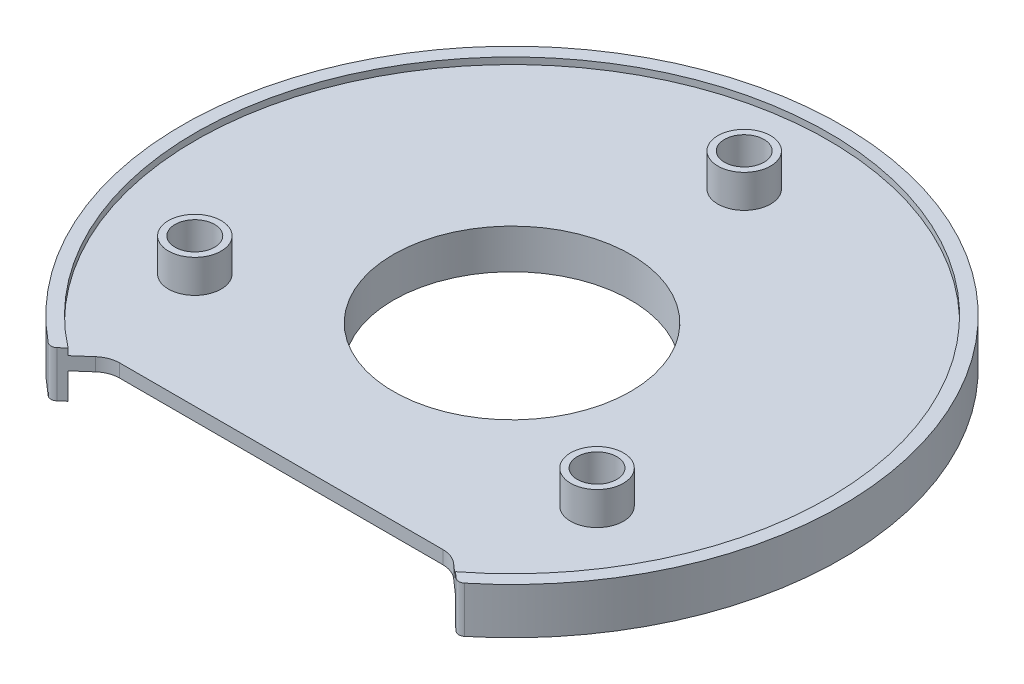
ISO-10303-21;
HEADER;
FILE_DESCRIPTION(('STEP AP214'),'2;1');
FILE_NAME('part.step','',(''),(''),'','','');
FILE_SCHEMA(('AUTOMOTIVE_DESIGN { 1 0 10303 214 1 1 1 1 }'));
ENDSEC;
DATA;
#1=APPLICATION_CONTEXT('core data for automotive mechanical design processes');
#2=APPLICATION_PROTOCOL_DEFINITION('international standard','automotive_design',2000,#1);
#3=PRODUCT_CONTEXT('',#1,'mechanical');
#4=PRODUCT('Part','Part','',(#3));
#5=PRODUCT_RELATED_PRODUCT_CATEGORY('part','',(#4));
#6=PRODUCT_DEFINITION_FORMATION('','',#4);
#7=PRODUCT_DEFINITION_CONTEXT('part definition',#1,'design');
#8=PRODUCT_DEFINITION('design','',#6,#7);
#9=PRODUCT_DEFINITION_SHAPE('','',#8);
#10=(LENGTH_UNIT() NAMED_UNIT(*) SI_UNIT(.MILLI.,.METRE.));
#11=(NAMED_UNIT(*) PLANE_ANGLE_UNIT() SI_UNIT($,.RADIAN.));
#12=(NAMED_UNIT(*) SI_UNIT($,.STERADIAN.) SOLID_ANGLE_UNIT());
#13=UNCERTAINTY_MEASURE_WITH_UNIT(LENGTH_MEASURE(1.E-05),#10,'distance_accuracy_value','');
#14=(GEOMETRIC_REPRESENTATION_CONTEXT(3) GLOBAL_UNCERTAINTY_ASSIGNED_CONTEXT((#13)) GLOBAL_UNIT_ASSIGNED_CONTEXT((#10,
#11,#12)) REPRESENTATION_CONTEXT('',''));
#15=CARTESIAN_POINT('',(0.,0.,0.));
#16=DIRECTION('',(0.,0.,1.));
#17=DIRECTION('',(1.,0.,0.));
#18=AXIS2_PLACEMENT_3D('',#15,#16,#17);
#19=CARTESIAN_POINT('',(0.,3.,-35.2183664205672));
#20=DIRECTION('',(0.,1.,0.));
#21=DIRECTION('',(-1.,0.,0.));
#22=AXIS2_PLACEMENT_3D('',#19,#20,#21);
#23=CYLINDRICAL_SURFACE('',#22,3.);
#24=CARTESIAN_POINT('',(0.,3.,-35.2183664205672));
#25=DIRECTION('',(0.,1.,0.));
#26=DIRECTION('',(-1.,0.,0.));
#27=AXIS2_PLACEMENT_3D('',#24,#25,#26);
#28=CIRCLE('',#27,3.);
#29=CARTESIAN_POINT('',(-3.00000000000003,3.00000000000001,-35.2183664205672));
#30=VERTEX_POINT('',#29);
#31=EDGE_CURVE('E268',#30,#30,#28,.T.);
#32=ORIENTED_EDGE('',*,*,#31,.F.);
#33=EDGE_LOOP('',(#32));
#34=FACE_BOUND('',#33,.T.);
#35=CARTESIAN_POINT('',(0.,4.,-35.2183664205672));
#36=DIRECTION('',(0.,1.,0.));
#37=DIRECTION('',(-1.,0.,0.));
#38=AXIS2_PLACEMENT_3D('',#35,#36,#37);
#39=CIRCLE('',#38,3.);
#40=CARTESIAN_POINT('',(-3.00000000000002,4.00000000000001,-35.2183664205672));
#41=VERTEX_POINT('',#40);
#42=EDGE_CURVE('E19',#41,#41,#39,.T.);
#43=ORIENTED_EDGE('',*,*,#42,.T.);
#44=EDGE_LOOP('',(#43));
#45=FACE_BOUND('',#44,.T.);
#46=ADVANCED_FACE('F16',(#34,#45),#23,.F.);
#47=CARTESIAN_POINT('',(0.,4.,0.));
#48=DIRECTION('',(0.,1.,0.));
#49=DIRECTION('',(-1.,0.,0.));
#50=AXIS2_PLACEMENT_3D('',#47,#48,#49);
#51=PLANE('',#50);
#52=ORIENTED_EDGE('',*,*,#42,.F.);
#53=EDGE_LOOP('',(#52));
#54=FACE_BOUND('',#53,.T.);
#55=CARTESIAN_POINT('',(0.,4.,-35.2183664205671));
#56=DIRECTION('',(0.,1.,0.));
#57=DIRECTION('',(-1.,0.,0.));
#58=AXIS2_PLACEMENT_3D('',#55,#56,#57);
#59=CIRCLE('',#58,1.5);
#60=CARTESIAN_POINT('',(-1.50000000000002,4.,-35.2183664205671));
#61=VERTEX_POINT('',#60);
#62=EDGE_CURVE('E478',#61,#61,#59,.T.);
#63=ORIENTED_EDGE('',*,*,#62,.T.);
#64=EDGE_LOOP('',(#63));
#65=FACE_BOUND('',#64,.T.);
#66=ADVANCED_FACE('F487',(#54,#65),#51,.F.);
#67=CARTESIAN_POINT('',(0.,4.,0.));
#68=DIRECTION('',(0.,1.,0.));
#69=DIRECTION('',(-1.,0.,0.));
#70=AXIS2_PLACEMENT_3D('',#67,#68,#69);
#71=PLANE('',#70);
#72=CARTESIAN_POINT('',(30.5000000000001,4.00000000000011,17.6091832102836));
#73=DIRECTION('',(0.,1.,0.));
#74=DIRECTION('',(-1.,0.,0.));
#75=AXIS2_PLACEMENT_3D('',#72,#73,#74);
#76=CIRCLE('',#75,3.);
#77=CARTESIAN_POINT('',(27.5000000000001,4.00000000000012,17.6091832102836));
#78=VERTEX_POINT('',#77);
#79=EDGE_CURVE('E469',#78,#78,#76,.F.);
#80=ORIENTED_EDGE('',*,*,#79,.T.);
#81=EDGE_LOOP('',(#80));
#82=FACE_BOUND('',#81,.T.);
#83=CARTESIAN_POINT('',(30.5000000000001,4.00000000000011,17.6091832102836));
#84=DIRECTION('',(0.,1.,0.));
#85=DIRECTION('',(-1.,0.,0.));
#86=AXIS2_PLACEMENT_3D('',#83,#84,#85);
#87=CIRCLE('',#86,1.5);
#88=CARTESIAN_POINT('',(29.0000000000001,4.00000000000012,17.6091832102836));
#89=VERTEX_POINT('',#88);
#90=EDGE_CURVE('E258',#89,#89,#87,.T.);
#91=ORIENTED_EDGE('',*,*,#90,.T.);
#92=EDGE_LOOP('',(#91));
#93=FACE_BOUND('',#92,.T.);
#94=ADVANCED_FACE('F490',(#82,#93),#71,.F.);
#95=CARTESIAN_POINT('',(0.,4.,0.));
#96=DIRECTION('',(0.,1.,0.));
#97=DIRECTION('',(-1.,0.,0.));
#98=AXIS2_PLACEMENT_3D('',#95,#96,#97);
#99=PLANE('',#98);
#100=CARTESIAN_POINT('',(-30.4999999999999,3.9999999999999,17.6091832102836));
#101=DIRECTION('',(0.,1.,0.));
#102=DIRECTION('',(-1.,0.,0.));
#103=AXIS2_PLACEMENT_3D('',#100,#101,#102);
#104=CIRCLE('',#103,3.);
#105=CARTESIAN_POINT('',(-33.4999999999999,3.99999999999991,17.6091832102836));
#106=VERTEX_POINT('',#105);
#107=EDGE_CURVE('E465',#106,#106,#104,.F.);
#108=ORIENTED_EDGE('',*,*,#107,.T.);
#109=EDGE_LOOP('',(#108));
#110=FACE_BOUND('',#109,.T.);
#111=CARTESIAN_POINT('',(-30.4999999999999,3.9999999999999,17.6091832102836));
#112=DIRECTION('',(0.,1.,0.));
#113=DIRECTION('',(-1.,0.,0.));
#114=AXIS2_PLACEMENT_3D('',#111,#112,#113);
#115=CIRCLE('',#114,1.5);
#116=CARTESIAN_POINT('',(-31.9999999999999,3.99999999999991,17.6091832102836));
#117=VERTEX_POINT('',#116);
#118=EDGE_CURVE('E475',#117,#117,#115,.T.);
#119=ORIENTED_EDGE('',*,*,#118,.T.);
#120=EDGE_LOOP('',(#119));
#121=FACE_BOUND('',#120,.T.);
#122=ADVANCED_FACE('F506',(#110,#121),#99,.F.);
#123=CARTESIAN_POINT('',(0.,3.,-35.2183664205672));
#124=DIRECTION('',(0.,-1.,0.));
#125=DIRECTION('',(1.,0.,0.));
#126=AXIS2_PLACEMENT_3D('',#123,#124,#125);
#127=PLANE('',#126);
#128=CARTESIAN_POINT('',(0.,3.,0.));
#129=DIRECTION('',(0.,-1.,0.));
#130=DIRECTION('',(1.,0.,0.));
#131=AXIS2_PLACEMENT_3D('',#128,#129,#130);
#132=CIRCLE('',#131,21.);
#133=CARTESIAN_POINT('',(0.99999999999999,3.00000000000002,-20.976176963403));
#134=VERTEX_POINT('',#133);
#135=CARTESIAN_POINT('',(-1.00000000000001,3.00000000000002,-20.976176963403));
#136=VERTEX_POINT('',#135);
#137=EDGE_CURVE('E267',#134,#136,#132,.F.);
#138=ORIENTED_EDGE('',*,*,#137,.T.);
#139=DIRECTION('',(0.,0.,1.));
#140=VECTOR('',#139,1.);
#141=CARTESIAN_POINT('',(-1.00000000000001,3.,-21.));
#142=LINE('',#141,#140);
#143=CARTESIAN_POINT('',(-1.00000000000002,2.99999999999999,-31.3453830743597));
#144=VERTEX_POINT('',#143);
#145=EDGE_CURVE('E1144',#144,#136,#142,.T.);
#146=ORIENTED_EDGE('',*,*,#145,.F.);
#147=CARTESIAN_POINT('',(0.,2.99999999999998,-35.2183664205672));
#148=DIRECTION('',(0.,1.,0.));
#149=DIRECTION('',(-1.,0.,0.));
#150=AXIS2_PLACEMENT_3D('',#147,#148,#149);
#151=CIRCLE('',#150,4.);
#152=CARTESIAN_POINT('',(-1.00000000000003,2.99999999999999,-39.0913497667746));
#153=VERTEX_POINT('',#152);
#154=EDGE_CURVE('E461',#153,#144,#151,.T.);
#155=ORIENTED_EDGE('',*,*,#154,.F.);
#156=DIRECTION('',(0.,0.,1.));
#157=VECTOR('',#156,1.);
#158=CARTESIAN_POINT('',(-1.00000000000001,3.,-21.));
#159=LINE('',#158,#157);
#160=CARTESIAN_POINT('',(-1.00000000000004,2.9999999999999,-47.9895822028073));
#161=VERTEX_POINT('',#160);
#162=EDGE_CURVE('E265',#153,#161,#159,.F.);
#163=ORIENTED_EDGE('',*,*,#162,.T.);
#164=CARTESIAN_POINT('',(0.,3.,0.));
#165=DIRECTION('',(0.,-1.,0.));
#166=DIRECTION('',(1.,0.,0.));
#167=AXIS2_PLACEMENT_3D('',#164,#165,#166);
#168=CIRCLE('',#167,48.);
#169=CARTESIAN_POINT('',(0.999999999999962,3.00000000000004,-47.9895822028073));
#170=VERTEX_POINT('',#169);
#171=EDGE_CURVE('E250',#161,#170,#168,.T.);
#172=ORIENTED_EDGE('',*,*,#171,.T.);
#173=DIRECTION('',(0.,0.,1.));
#174=VECTOR('',#173,1.);
#175=CARTESIAN_POINT('',(0.99999999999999,3.,-21.));
#176=LINE('',#175,#174);
#177=CARTESIAN_POINT('',(0.999999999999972,3.,-39.0913497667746));
#178=VERTEX_POINT('',#177);
#179=EDGE_CURVE('E257',#178,#170,#176,.F.);
#180=ORIENTED_EDGE('',*,*,#179,.F.);
#181=CARTESIAN_POINT('',(0.,3.00000000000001,-35.2183664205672));
#182=DIRECTION('',(0.,1.,0.));
#183=DIRECTION('',(-1.,0.,0.));
#184=AXIS2_PLACEMENT_3D('',#181,#182,#183);
#185=CIRCLE('',#184,4.);
#186=CARTESIAN_POINT('',(0.999999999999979,3.,-31.3453830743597));
#187=VERTEX_POINT('',#186);
#188=EDGE_CURVE('E274',#187,#178,#185,.T.);
#189=ORIENTED_EDGE('',*,*,#188,.F.);
#190=DIRECTION('',(0.,0.,1.));
#191=VECTOR('',#190,1.);
#192=CARTESIAN_POINT('',(0.99999999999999,3.,-21.));
#193=LINE('',#192,#191);
#194=EDGE_CURVE('E278',#187,#134,#193,.T.);
#195=ORIENTED_EDGE('',*,*,#194,.T.);
#196=EDGE_LOOP('',(#138,#146,#155,#163,#172,#180,#189,#195));
#197=FACE_BOUND('',#196,.T.);
#198=ORIENTED_EDGE('',*,*,#31,.T.);
#199=EDGE_LOOP('',(#198));
#200=FACE_BOUND('',#199,.T.);
#201=ADVANCED_FACE('F261',(#197,#200),#127,.T.);
#202=CARTESIAN_POINT('',(0.,0.,-35.2183664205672));
#203=DIRECTION('',(0.,1.,0.));
#204=DIRECTION('',(-1.,0.,0.));
#205=AXIS2_PLACEMENT_3D('',#202,#203,#204);
#206=CYLINDRICAL_SURFACE('',#205,1.5);
#207=CARTESIAN_POINT('',(0.,6.,-35.2183664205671));
#208=DIRECTION('',(0.,1.,0.));
#209=DIRECTION('',(-1.,0.,0.));
#210=AXIS2_PLACEMENT_3D('',#207,#208,#209);
#211=CIRCLE('',#210,1.5);
#212=CARTESIAN_POINT('',(-1.50000000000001,6.00000000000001,-35.2183664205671));
#213=VERTEX_POINT('',#212);
#214=EDGE_CURVE('E457',#213,#213,#211,.F.);
#215=ORIENTED_EDGE('',*,*,#214,.F.);
#216=EDGE_LOOP('',(#215));
#217=FACE_BOUND('',#216,.T.);
#218=ORIENTED_EDGE('',*,*,#62,.F.);
#219=EDGE_LOOP('',(#218));
#220=FACE_BOUND('',#219,.T.);
#221=ADVANCED_FACE('F493',(#217,#220),#206,.F.);
#222=CARTESIAN_POINT('',(-30.4999999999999,-1.04083408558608E-13,17.6091832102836));
#223=DIRECTION('',(0.,1.,0.));
#224=DIRECTION('',(-1.,0.,0.));
#225=AXIS2_PLACEMENT_3D('',#222,#223,#224);
#226=CYLINDRICAL_SURFACE('',#225,1.5);
#227=ORIENTED_EDGE('',*,*,#118,.F.);
#228=EDGE_LOOP('',(#227));
#229=FACE_BOUND('',#228,.T.);
#230=CARTESIAN_POINT('',(-30.4999999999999,6.,17.6091832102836));
#231=DIRECTION('',(0.,1.,0.));
#232=DIRECTION('',(-1.,0.,0.));
#233=AXIS2_PLACEMENT_3D('',#230,#231,#232);
#234=CIRCLE('',#233,1.5);
#235=CARTESIAN_POINT('',(-31.9999999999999,6.00000000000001,17.6091832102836));
#236=VERTEX_POINT('',#235);
#237=EDGE_CURVE('E454',#236,#236,#234,.F.);
#238=ORIENTED_EDGE('',*,*,#237,.F.);
#239=EDGE_LOOP('',(#238));
#240=FACE_BOUND('',#239,.T.);
#241=ADVANCED_FACE('F495',(#229,#240),#226,.F.);
#242=CARTESIAN_POINT('',(30.5000000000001,1.04083408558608E-13,17.6091832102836));
#243=DIRECTION('',(0.,1.,0.));
#244=DIRECTION('',(-1.,0.,0.));
#245=AXIS2_PLACEMENT_3D('',#242,#243,#244);
#246=CYLINDRICAL_SURFACE('',#245,1.5);
#247=ORIENTED_EDGE('',*,*,#90,.F.);
#248=EDGE_LOOP('',(#247));
#249=FACE_BOUND('',#248,.T.);
#250=CARTESIAN_POINT('',(30.5000000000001,6.00000000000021,17.6091832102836));
#251=DIRECTION('',(0.,1.,0.));
#252=DIRECTION('',(-1.,0.,0.));
#253=AXIS2_PLACEMENT_3D('',#250,#251,#252);
#254=CIRCLE('',#253,1.5);
#255=CARTESIAN_POINT('',(29.0000000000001,6.00000000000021,17.6091832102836));
#256=VERTEX_POINT('',#255);
#257=EDGE_CURVE('E451',#256,#256,#254,.F.);
#258=ORIENTED_EDGE('',*,*,#257,.F.);
#259=EDGE_LOOP('',(#258));
#260=FACE_BOUND('',#259,.T.);
#261=ADVANCED_FACE('F503',(#249,#260),#246,.F.);
#262=CARTESIAN_POINT('',(0.99999999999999,3.,-21.));
#263=DIRECTION('',(1.,0.,0.));
#264=DIRECTION('',(0.,1.,0.));
#265=AXIS2_PLACEMENT_3D('',#262,#263,#264);
#266=PLANE('',#265);
#267=DIRECTION('',(0.,1.,0.));
#268=VECTOR('',#267,1.);
#269=CARTESIAN_POINT('',(0.999999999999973,3.,-39.0913497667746));
#270=LINE('',#269,#268);
#271=CARTESIAN_POINT('',(0.999999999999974,3.99999999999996,-39.0913497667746));
#272=VERTEX_POINT('',#271);
#273=EDGE_CURVE('E272',#178,#272,#270,.T.);
#274=ORIENTED_EDGE('',*,*,#273,.F.);
#275=ORIENTED_EDGE('',*,*,#179,.T.);
#276=DIRECTION('',(0.,1.,0.));
#277=VECTOR('',#276,1.);
#278=CARTESIAN_POINT('',(0.999999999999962,3.,-47.9895822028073));
#279=LINE('',#278,#277);
#280=CARTESIAN_POINT('',(0.999999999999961,3.99999999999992,-47.9895822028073));
#281=VERTEX_POINT('',#280);
#282=EDGE_CURVE('E247',#170,#281,#279,.T.);
#283=ORIENTED_EDGE('',*,*,#282,.T.);
#284=DIRECTION('',(0.,0.,1.));
#285=VECTOR('',#284,1.);
#286=CARTESIAN_POINT('',(0.999999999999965,4.,0.));
#287=LINE('',#286,#285);
#288=EDGE_CURVE('E446',#281,#272,#287,.T.);
#289=ORIENTED_EDGE('',*,*,#288,.T.);
#290=EDGE_LOOP('',(#274,#275,#283,#289));
#291=FACE_BOUND('',#290,.T.);
#292=ADVANCED_FACE('F270',(#291),#266,.T.);
#293=CARTESIAN_POINT('',(0.,3.,-35.2183664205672));
#294=DIRECTION('',(0.,1.,0.));
#295=DIRECTION('',(-1.,0.,0.));
#296=AXIS2_PLACEMENT_3D('',#293,#294,#295);
#297=CYLINDRICAL_SURFACE('',#296,4.);
#298=CARTESIAN_POINT('',(0.,3.99999999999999,-35.2183664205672));
#299=DIRECTION('',(0.,1.,0.));
#300=DIRECTION('',(-1.,0.,0.));
#301=AXIS2_PLACEMENT_3D('',#298,#299,#300);
#302=CIRCLE('',#301,4.);
#303=CARTESIAN_POINT('',(0.999999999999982,3.99999999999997,-31.3453830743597));
#304=VERTEX_POINT('',#303);
#305=EDGE_CURVE('E444',#272,#304,#302,.F.);
#306=ORIENTED_EDGE('',*,*,#305,.T.);
#307=DIRECTION('',(0.,-1.,0.));
#308=VECTOR('',#307,1.);
#309=CARTESIAN_POINT('',(0.999999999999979,3.,-31.3453830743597));
#310=LINE('',#309,#308);
#311=EDGE_CURVE('E1116',#304,#187,#310,.T.);
#312=ORIENTED_EDGE('',*,*,#311,.T.);
#313=ORIENTED_EDGE('',*,*,#188,.T.);
#314=ORIENTED_EDGE('',*,*,#273,.T.);
#315=EDGE_LOOP('',(#306,#312,#313,#314));
#316=FACE_BOUND('',#315,.T.);
#317=ADVANCED_FACE('F713',(#316),#297,.T.);
#318=CARTESIAN_POINT('',(0.99999999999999,3.,-21.));
#319=DIRECTION('',(-1.,0.,0.));
#320=DIRECTION('',(0.,-1.,0.));
#321=AXIS2_PLACEMENT_3D('',#318,#319,#320);
#322=PLANE('',#321);
#323=ORIENTED_EDGE('',*,*,#311,.F.);
#324=DIRECTION('',(0.,0.,1.));
#325=VECTOR('',#324,1.);
#326=CARTESIAN_POINT('',(0.999999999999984,4.,0.));
#327=LINE('',#326,#325);
#328=CARTESIAN_POINT('',(0.999999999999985,3.99999999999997,-20.976176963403));
#329=VERTEX_POINT('',#328);
#330=EDGE_CURVE('E443',#304,#329,#327,.T.);
#331=ORIENTED_EDGE('',*,*,#330,.T.);
#332=DIRECTION('',(0.,-1.,0.));
#333=VECTOR('',#332,1.);
#334=CARTESIAN_POINT('',(0.99999999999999,3.,-20.976176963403));
#335=LINE('',#334,#333);
#336=EDGE_CURVE('E1123',#134,#329,#335,.F.);
#337=ORIENTED_EDGE('',*,*,#336,.F.);
#338=ORIENTED_EDGE('',*,*,#194,.F.);
#339=EDGE_LOOP('',(#323,#331,#337,#338));
#340=FACE_BOUND('',#339,.T.);
#341=ADVANCED_FACE('F709',(#340),#322,.F.);
#342=CARTESIAN_POINT('',(30.5000000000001,3.00000000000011,17.6091832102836));
#343=DIRECTION('',(0.,1.,0.));
#344=DIRECTION('',(-1.,0.,0.));
#345=AXIS2_PLACEMENT_3D('',#342,#343,#344);
#346=CYLINDRICAL_SURFACE('',#345,3.);
#347=CARTESIAN_POINT('',(30.5000000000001,3.00000000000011,17.6091832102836));
#348=DIRECTION('',(0.,1.,0.));
#349=DIRECTION('',(-1.,0.,0.));
#350=AXIS2_PLACEMENT_3D('',#347,#348,#349);
#351=CIRCLE('',#350,3.);
#352=CARTESIAN_POINT('',(27.5000000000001,3.00000000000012,17.6091832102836));
#353=VERTEX_POINT('',#352);
#354=EDGE_CURVE('E440',#353,#353,#351,.T.);
#355=ORIENTED_EDGE('',*,*,#354,.F.);
#356=EDGE_LOOP('',(#355));
#357=FACE_BOUND('',#356,.T.);
#358=ORIENTED_EDGE('',*,*,#79,.F.);
#359=EDGE_LOOP('',(#358));
#360=FACE_BOUND('',#359,.T.);
#361=ADVANCED_FACE('F705',(#357,#360),#346,.F.);
#362=CARTESIAN_POINT('',(18.6865334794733,3.00000000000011,9.63397459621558));
#363=DIRECTION('',(0.5,0.,-0.866025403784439));
#364=DIRECTION('',(-0.866025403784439,0.,-0.5));
#365=AXIS2_PLACEMENT_3D('',#362,#363,#364);
#366=PLANE('',#365);
#367=DIRECTION('',(0.866025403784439,0.,0.5));
#368=VECTOR('',#367,1.);
#369=CARTESIAN_POINT('',(18.665902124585,3.00000000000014,9.6220630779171));
#370=LINE('',#369,#368);
#371=CARTESIAN_POINT('',(18.665902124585,3.00000000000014,9.62206307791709));
#372=VERTEX_POINT('',#371);
#373=CARTESIAN_POINT('',(27.6458980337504,3.00000000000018,14.8066661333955));
#374=VERTEX_POINT('',#373);
#375=EDGE_CURVE('E439',#372,#374,#370,.T.);
#376=ORIENTED_EDGE('',*,*,#375,.F.);
#377=DIRECTION('',(0.,1.,0.));
#378=VECTOR('',#377,1.);
#379=CARTESIAN_POINT('',(18.665902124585,3.00000000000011,9.6220630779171));
#380=LINE('',#379,#378);
#381=CARTESIAN_POINT('',(18.665902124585,3.99999999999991,9.6220630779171));
#382=VERTEX_POINT('',#381);
#383=EDGE_CURVE('E471',#372,#382,#380,.T.);
#384=ORIENTED_EDGE('',*,*,#383,.T.);
#385=DIRECTION('',(0.866025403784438,0.,0.500000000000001));
#386=VECTOR('',#385,1.);
#387=CARTESIAN_POINT('',(18.665902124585,3.99999999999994,9.6220630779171));
#388=LINE('',#387,#386);
#389=CARTESIAN_POINT('',(27.6458980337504,4.00000000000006,14.8066661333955));
#390=VERTEX_POINT('',#389);
#391=EDGE_CURVE('E450',#382,#390,#388,.T.);
#392=ORIENTED_EDGE('',*,*,#391,.T.);
#393=DIRECTION('',(0.,1.,0.));
#394=VECTOR('',#393,1.);
#395=CARTESIAN_POINT('',(27.6458980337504,3.00000000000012,14.8066661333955));
#396=LINE('',#395,#394);
#397=EDGE_CURVE('E1158',#374,#390,#396,.T.);
#398=ORIENTED_EDGE('',*,*,#397,.F.);
#399=EDGE_LOOP('',(#376,#384,#392,#398));
#400=FACE_BOUND('',#399,.T.);
#401=ADVANCED_FACE('F701',(#400),#366,.T.);
#402=CARTESIAN_POINT('',(30.5000000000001,3.00000000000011,17.6091832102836));
#403=DIRECTION('',(0.,1.,0.));
#404=DIRECTION('',(-1.,0.,0.));
#405=AXIS2_PLACEMENT_3D('',#402,#403,#404);
#406=CYLINDRICAL_SURFACE('',#405,4.);
#407=ORIENTED_EDGE('',*,*,#397,.T.);
#408=CARTESIAN_POINT('',(30.5000000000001,4.00000000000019,17.6091832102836));
#409=DIRECTION('',(0.,1.,0.));
#410=DIRECTION('',(-1.,0.,0.));
#411=AXIS2_PLACEMENT_3D('',#408,#409,#410);
#412=CIRCLE('',#411,4.);
#413=CARTESIAN_POINT('',(34.3541019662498,4.00000000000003,18.6796494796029));
#414=VERTEX_POINT('',#413);
#415=EDGE_CURVE('E447',#390,#414,#412,.F.);
#416=ORIENTED_EDGE('',*,*,#415,.T.);
#417=DIRECTION('',(0.,1.,0.));
#418=VECTOR('',#417,1.);
#419=CARTESIAN_POINT('',(34.3541019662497,3.00000000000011,18.6796494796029));
#420=LINE('',#419,#418);
#421=CARTESIAN_POINT('',(34.3541019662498,3.00000000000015,18.6796494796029));
#422=VERTEX_POINT('',#421);
#423=EDGE_CURVE('E1156',#414,#422,#420,.F.);
#424=ORIENTED_EDGE('',*,*,#423,.T.);
#425=CARTESIAN_POINT('',(30.5000000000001,3.00000000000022,17.6091832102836));
#426=DIRECTION('',(0.,1.,0.));
#427=DIRECTION('',(-1.,0.,0.));
#428=AXIS2_PLACEMENT_3D('',#425,#426,#427);
#429=CIRCLE('',#428,4.);
#430=EDGE_CURVE('E436',#374,#422,#429,.F.);
#431=ORIENTED_EDGE('',*,*,#430,.F.);
#432=EDGE_LOOP('',(#407,#416,#424,#431));
#433=FACE_BOUND('',#432,.T.);
#434=ADVANCED_FACE('F697',(#433),#406,.T.);
#435=CARTESIAN_POINT('',(18.6865334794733,3.00000000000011,9.63397459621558));
#436=DIRECTION('',(-0.5,0.,0.866025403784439));
#437=DIRECTION('',(0.866025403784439,0.,0.5));
#438=AXIS2_PLACEMENT_3D('',#435,#436,#437);
#439=PLANE('',#438);
#440=DIRECTION('',(0.,1.,0.));
#441=VECTOR('',#440,1.);
#442=CARTESIAN_POINT('',(42.0601973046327,3.00000000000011,23.1287656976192));
#443=LINE('',#442,#441);
#444=CARTESIAN_POINT('',(42.0601973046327,3.0000000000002,23.1287656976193));
#445=VERTEX_POINT('',#444);
#446=CARTESIAN_POINT('',(42.0601973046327,3.99999999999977,23.1287656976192));
#447=VERTEX_POINT('',#446);
#448=EDGE_CURVE('E468',#445,#447,#443,.T.);
#449=ORIENTED_EDGE('',*,*,#448,.F.);
#450=DIRECTION('',(0.866025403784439,0.,0.5));
#451=VECTOR('',#450,1.);
#452=CARTESIAN_POINT('',(34.3541019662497,3.00000000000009,18.6796494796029));
#453=LINE('',#452,#451);
#454=EDGE_CURVE('E435',#422,#445,#453,.T.);
#455=ORIENTED_EDGE('',*,*,#454,.F.);
#456=ORIENTED_EDGE('',*,*,#423,.F.);
#457=DIRECTION('',(0.866025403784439,0.,0.5));
#458=VECTOR('',#457,1.);
#459=CARTESIAN_POINT('',(34.3541019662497,3.99999999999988,18.6796494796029));
#460=LINE('',#459,#458);
#461=EDGE_CURVE('E449',#414,#447,#460,.T.);
#462=ORIENTED_EDGE('',*,*,#461,.T.);
#463=EDGE_LOOP('',(#449,#455,#456,#462));
#464=FACE_BOUND('',#463,.T.);
#465=ADVANCED_FACE('F693',(#464),#439,.F.);
#466=CARTESIAN_POINT('',(-30.4999999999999,2.9999999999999,17.6091832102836));
#467=DIRECTION('',(0.,1.,0.));
#468=DIRECTION('',(-1.,0.,0.));
#469=AXIS2_PLACEMENT_3D('',#466,#467,#468);
#470=CYLINDRICAL_SURFACE('',#469,3.);
#471=CARTESIAN_POINT('',(-30.4999999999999,2.9999999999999,17.6091832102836));
#472=DIRECTION('',(0.,1.,0.));
#473=DIRECTION('',(-1.,0.,0.));
#474=AXIS2_PLACEMENT_3D('',#471,#472,#473);
#475=CIRCLE('',#474,3.);
#476=CARTESIAN_POINT('',(-33.4999999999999,2.99999999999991,17.6091832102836));
#477=VERTEX_POINT('',#476);
#478=EDGE_CURVE('E428',#477,#477,#475,.T.);
#479=ORIENTED_EDGE('',*,*,#478,.F.);
#480=EDGE_LOOP('',(#479));
#481=FACE_BOUND('',#480,.T.);
#482=ORIENTED_EDGE('',*,*,#107,.F.);
#483=EDGE_LOOP('',(#482));
#484=FACE_BOUND('',#483,.T.);
#485=ADVANCED_FACE('F689',(#481,#484),#470,.F.);
#486=CARTESIAN_POINT('',(-1.00000000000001,3.,-21.));
#487=DIRECTION('',(1.,0.,0.));
#488=DIRECTION('',(0.,1.,0.));
#489=AXIS2_PLACEMENT_3D('',#486,#487,#488);
#490=PLANE('',#489);
#491=DIRECTION('',(0.,1.,0.));
#492=VECTOR('',#491,1.);
#493=CARTESIAN_POINT('',(-1.00000000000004,3.,-47.9895822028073));
#494=LINE('',#493,#492);
#495=CARTESIAN_POINT('',(-1.00000000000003,3.99999999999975,-47.9895822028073));
#496=VERTEX_POINT('',#495);
#497=EDGE_CURVE('E1154',#161,#496,#494,.T.);
#498=ORIENTED_EDGE('',*,*,#497,.F.);
#499=ORIENTED_EDGE('',*,*,#162,.F.);
#500=DIRECTION('',(0.,1.,0.));
#501=VECTOR('',#500,1.);
#502=CARTESIAN_POINT('',(-1.00000000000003,3.00000000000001,-39.0913497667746));
#503=LINE('',#502,#501);
#504=CARTESIAN_POINT('',(-1.00000000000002,3.99999999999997,-39.0913497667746));
#505=VERTEX_POINT('',#504);
#506=EDGE_CURVE('E464',#505,#153,#503,.F.);
#507=ORIENTED_EDGE('',*,*,#506,.F.);
#508=DIRECTION('',(0.,0.,1.));
#509=VECTOR('',#508,1.);
#510=CARTESIAN_POINT('',(-1.00000000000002,4.00000000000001,0.));
#511=LINE('',#510,#509);
#512=EDGE_CURVE('E1183',#505,#496,#511,.F.);
#513=ORIENTED_EDGE('',*,*,#512,.T.);
#514=EDGE_LOOP('',(#498,#499,#507,#513));
#515=FACE_BOUND('',#514,.T.);
#516=ADVANCED_FACE('F685',(#515),#490,.F.);
#517=CARTESIAN_POINT('',(-18.6865334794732,2.9999999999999,9.63397459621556));
#518=DIRECTION('',(-0.5,0.,-0.866025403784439));
#519=DIRECTION('',(-0.866025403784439,0.,0.5));
#520=AXIS2_PLACEMENT_3D('',#517,#518,#519);
#521=PLANE('',#520);
#522=DIRECTION('',(0.,1.,0.));
#523=VECTOR('',#522,1.);
#524=CARTESIAN_POINT('',(-34.3541019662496,2.99999999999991,18.6796494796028));
#525=LINE('',#524,#523);
#526=CARTESIAN_POINT('',(-34.3541019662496,2.99999999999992,18.6796494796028));
#527=VERTEX_POINT('',#526);
#528=CARTESIAN_POINT('',(-34.3541019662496,4.00000000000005,18.6796494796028));
#529=VERTEX_POINT('',#528);
#530=EDGE_CURVE('E1149',#527,#529,#525,.T.);
#531=ORIENTED_EDGE('',*,*,#530,.F.);
#532=DIRECTION('',(0.866025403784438,0.,-0.5));
#533=VECTOR('',#532,1.);
#534=CARTESIAN_POINT('',(-42.0601973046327,2.99999999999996,23.1287656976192));
#535=LINE('',#534,#533);
#536=CARTESIAN_POINT('',(-42.0601973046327,2.99999999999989,23.1287656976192));
#537=VERTEX_POINT('',#536);
#538=EDGE_CURVE('E427',#537,#527,#535,.T.);
#539=ORIENTED_EDGE('',*,*,#538,.F.);
#540=DIRECTION('',(0.,1.,0.));
#541=VECTOR('',#540,1.);
#542=CARTESIAN_POINT('',(-42.0601973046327,2.9999999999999,23.1287656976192));
#543=LINE('',#542,#541);
#544=CARTESIAN_POINT('',(-42.0601973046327,4.00000000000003,23.1287656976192));
#545=VERTEX_POINT('',#544);
#546=EDGE_CURVE('E1152',#537,#545,#543,.T.);
#547=ORIENTED_EDGE('',*,*,#546,.T.);
#548=DIRECTION('',(0.866025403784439,0.,-0.5));
#549=VECTOR('',#548,1.);
#550=CARTESIAN_POINT('',(-42.0601973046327,4.00000000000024,23.1287656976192));
#551=LINE('',#550,#549);
#552=EDGE_CURVE('E422',#545,#529,#551,.T.);
#553=ORIENTED_EDGE('',*,*,#552,.T.);
#554=EDGE_LOOP('',(#531,#539,#547,#553));
#555=FACE_BOUND('',#554,.T.);
#556=ADVANCED_FACE('F681',(#555),#521,.T.);
#557=CARTESIAN_POINT('',(-30.4999999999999,2.9999999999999,17.6091832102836));
#558=DIRECTION('',(0.,1.,0.));
#559=DIRECTION('',(-1.,0.,0.));
#560=AXIS2_PLACEMENT_3D('',#557,#558,#559);
#561=CYLINDRICAL_SURFACE('',#560,4.);
#562=CARTESIAN_POINT('',(-30.4999999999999,3.99999999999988,17.6091832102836));
#563=DIRECTION('',(0.,1.,0.));
#564=DIRECTION('',(-1.,0.,0.));
#565=AXIS2_PLACEMENT_3D('',#562,#563,#564);
#566=CIRCLE('',#565,4.);
#567=CARTESIAN_POINT('',(-27.6458980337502,4.00000000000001,14.8066661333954));
#568=VERTEX_POINT('',#567);
#569=EDGE_CURVE('E419',#529,#568,#566,.F.);
#570=ORIENTED_EDGE('',*,*,#569,.T.);
#571=DIRECTION('',(0.,1.,0.));
#572=VECTOR('',#571,1.);
#573=CARTESIAN_POINT('',(-27.6458980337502,2.9999999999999,14.8066661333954));
#574=LINE('',#573,#572);
#575=CARTESIAN_POINT('',(-27.6458980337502,2.99999999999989,14.8066661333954));
#576=VERTEX_POINT('',#575);
#577=EDGE_CURVE('E1145',#568,#576,#574,.F.);
#578=ORIENTED_EDGE('',*,*,#577,.T.);
#579=CARTESIAN_POINT('',(-30.4999999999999,2.9999999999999,17.6091832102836));
#580=DIRECTION('',(0.,1.,0.));
#581=DIRECTION('',(-1.,0.,0.));
#582=AXIS2_PLACEMENT_3D('',#579,#580,#581);
#583=CIRCLE('',#582,4.);
#584=EDGE_CURVE('E423',#527,#576,#583,.F.);
#585=ORIENTED_EDGE('',*,*,#584,.F.);
#586=ORIENTED_EDGE('',*,*,#530,.T.);
#587=EDGE_LOOP('',(#570,#578,#585,#586));
#588=FACE_BOUND('',#587,.T.);
#589=ADVANCED_FACE('F677',(#588),#561,.T.);
#590=CARTESIAN_POINT('',(-18.6865334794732,2.9999999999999,9.63397459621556));
#591=DIRECTION('',(0.5,0.,0.866025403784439));
#592=DIRECTION('',(0.866025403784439,0.,-0.5));
#593=AXIS2_PLACEMENT_3D('',#590,#591,#592);
#594=PLANE('',#593);
#595=ORIENTED_EDGE('',*,*,#577,.F.);
#596=DIRECTION('',(0.86602540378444,0.,-0.499999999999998));
#597=VECTOR('',#596,1.);
#598=CARTESIAN_POINT('',(-27.6458980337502,4.00000000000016,14.8066661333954));
#599=LINE('',#598,#597);
#600=CARTESIAN_POINT('',(-18.6659021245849,4.,9.62206307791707));
#601=VERTEX_POINT('',#600);
#602=EDGE_CURVE('E421',#568,#601,#599,.T.);
#603=ORIENTED_EDGE('',*,*,#602,.T.);
#604=DIRECTION('',(0.,1.,0.));
#605=VECTOR('',#604,1.);
#606=CARTESIAN_POINT('',(-18.6659021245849,2.9999999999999,9.62206307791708));
#607=LINE('',#606,#605);
#608=CARTESIAN_POINT('',(-18.6659021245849,2.99999999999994,9.62206307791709));
#609=VERTEX_POINT('',#608);
#610=EDGE_CURVE('E1147',#609,#601,#607,.T.);
#611=ORIENTED_EDGE('',*,*,#610,.F.);
#612=DIRECTION('',(0.86602540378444,0.,-0.499999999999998));
#613=VECTOR('',#612,1.);
#614=CARTESIAN_POINT('',(-27.6458980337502,2.99999999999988,14.8066661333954));
#615=LINE('',#614,#613);
#616=EDGE_CURVE('E426',#576,#609,#615,.T.);
#617=ORIENTED_EDGE('',*,*,#616,.F.);
#618=EDGE_LOOP('',(#595,#603,#611,#617));
#619=FACE_BOUND('',#618,.T.);
#620=ADVANCED_FACE('F673',(#619),#594,.F.);
#621=CARTESIAN_POINT('',(-1.00000000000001,3.,-21.));
#622=DIRECTION('',(-1.,0.,0.));
#623=DIRECTION('',(0.,-1.,0.));
#624=AXIS2_PLACEMENT_3D('',#621,#622,#623);
#625=PLANE('',#624);
#626=ORIENTED_EDGE('',*,*,#145,.T.);
#627=DIRECTION('',(0.,-1.,0.));
#628=VECTOR('',#627,1.);
#629=CARTESIAN_POINT('',(-1.00000000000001,3.,-20.976176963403));
#630=LINE('',#629,#628);
#631=CARTESIAN_POINT('',(-1.00000000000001,3.99999999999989,-20.976176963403));
#632=VERTEX_POINT('',#631);
#633=EDGE_CURVE('E1142',#136,#632,#630,.F.);
#634=ORIENTED_EDGE('',*,*,#633,.T.);
#635=DIRECTION('',(0.,0.,1.));
#636=VECTOR('',#635,1.);
#637=CARTESIAN_POINT('',(-1.00000000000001,4.00000000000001,0.));
#638=LINE('',#637,#636);
#639=CARTESIAN_POINT('',(-1.00000000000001,3.99999999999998,-31.3453830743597));
#640=VERTEX_POINT('',#639);
#641=EDGE_CURVE('E418',#632,#640,#638,.F.);
#642=ORIENTED_EDGE('',*,*,#641,.T.);
#643=DIRECTION('',(0.,1.,0.));
#644=VECTOR('',#643,1.);
#645=CARTESIAN_POINT('',(-1.00000000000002,2.99999999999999,-31.3453830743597));
#646=LINE('',#645,#644);
#647=EDGE_CURVE('E460',#144,#640,#646,.T.);
#648=ORIENTED_EDGE('',*,*,#647,.F.);
#649=EDGE_LOOP('',(#626,#634,#642,#648));
#650=FACE_BOUND('',#649,.T.);
#651=ADVANCED_FACE('F669',(#650),#625,.T.);
#652=CARTESIAN_POINT('',(0.,3.,-35.2183664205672));
#653=DIRECTION('',(0.,1.,0.));
#654=DIRECTION('',(-1.,0.,0.));
#655=AXIS2_PLACEMENT_3D('',#652,#653,#654);
#656=CYLINDRICAL_SURFACE('',#655,4.);
#657=ORIENTED_EDGE('',*,*,#647,.T.);
#658=CARTESIAN_POINT('',(0.,4.,-35.2183664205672));
#659=DIRECTION('',(0.,1.,0.));
#660=DIRECTION('',(-1.,0.,0.));
#661=AXIS2_PLACEMENT_3D('',#658,#659,#660);
#662=CIRCLE('',#661,4.);
#663=EDGE_CURVE('E415',#640,#505,#662,.F.);
#664=ORIENTED_EDGE('',*,*,#663,.T.);
#665=ORIENTED_EDGE('',*,*,#506,.T.);
#666=ORIENTED_EDGE('',*,*,#154,.T.);
#667=EDGE_LOOP('',(#657,#664,#665,#666));
#668=FACE_BOUND('',#667,.T.);
#669=ADVANCED_FACE('F665',(#668),#656,.T.);
#670=CARTESIAN_POINT('',(30.935416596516,6.00000000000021,38.));
#671=DIRECTION('',(0.,1.,0.));
#672=DIRECTION('',(-1.,0.,0.));
#673=AXIS2_PLACEMENT_3D('',#670,#671,#672);
#674=PLANE('',#673);
#675=CARTESIAN_POINT('',(0.,6.,-35.2183664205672));
#676=DIRECTION('',(0.,-1.,0.));
#677=DIRECTION('',(1.,0.,0.));
#678=AXIS2_PLACEMENT_3D('',#675,#676,#677);
#679=CIRCLE('',#678,3.);
#680=CARTESIAN_POINT('',(2.99999999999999,5.99999999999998,-35.2183664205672));
#681=VERTEX_POINT('',#680);
#682=EDGE_CURVE('E389',#681,#681,#679,.F.);
#683=ORIENTED_EDGE('',*,*,#682,.T.);
#684=EDGE_LOOP('',(#683));
#685=FACE_BOUND('',#684,.T.);
#686=ORIENTED_EDGE('',*,*,#214,.T.);
#687=EDGE_LOOP('',(#686));
#688=FACE_BOUND('',#687,.T.);
#689=ADVANCED_FACE('F661',(#685,#688),#674,.T.);
#690=CARTESIAN_POINT('',(0.,6.,0.));
#691=DIRECTION('',(0.,1.,0.));
#692=DIRECTION('',(-1.,0.,0.));
#693=AXIS2_PLACEMENT_3D('',#690,#691,#692);
#694=PLANE('',#693);
#695=CARTESIAN_POINT('',(-30.4999999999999,6.,17.6091832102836));
#696=DIRECTION('',(0.,1.,0.));
#697=DIRECTION('',(-1.,0.,0.));
#698=AXIS2_PLACEMENT_3D('',#695,#696,#697);
#699=CIRCLE('',#698,3.);
#700=CARTESIAN_POINT('',(-33.4999999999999,6.00000000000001,17.6091832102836));
#701=VERTEX_POINT('',#700);
#702=EDGE_CURVE('E386',#701,#701,#699,.T.);
#703=ORIENTED_EDGE('',*,*,#702,.T.);
#704=EDGE_LOOP('',(#703));
#705=FACE_BOUND('',#704,.T.);
#706=ORIENTED_EDGE('',*,*,#237,.T.);
#707=EDGE_LOOP('',(#706));
#708=FACE_BOUND('',#707,.T.);
#709=ADVANCED_FACE('F657',(#705,#708),#694,.T.);
#710=CARTESIAN_POINT('',(0.,6.,0.));
#711=DIRECTION('',(0.,1.,0.));
#712=DIRECTION('',(-1.,0.,0.));
#713=AXIS2_PLACEMENT_3D('',#710,#711,#712);
#714=PLANE('',#713);
#715=CARTESIAN_POINT('',(30.5000000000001,6.00000000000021,17.6091832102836));
#716=DIRECTION('',(0.,1.,0.));
#717=DIRECTION('',(-1.,0.,0.));
#718=AXIS2_PLACEMENT_3D('',#715,#716,#717);
#719=CIRCLE('',#718,3.00000000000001);
#720=CARTESIAN_POINT('',(27.5000000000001,6.00000000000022,17.6091832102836));
#721=VERTEX_POINT('',#720);
#722=EDGE_CURVE('E383',#721,#721,#719,.T.);
#723=ORIENTED_EDGE('',*,*,#722,.T.);
#724=EDGE_LOOP('',(#723));
#725=FACE_BOUND('',#724,.T.);
#726=ORIENTED_EDGE('',*,*,#257,.T.);
#727=EDGE_LOOP('',(#726));
#728=FACE_BOUND('',#727,.T.);
#729=ADVANCED_FACE('F653',(#725,#728),#714,.T.);
#730=CARTESIAN_POINT('',(0.,4.,0.));
#731=DIRECTION('',(0.,1.,0.));
#732=DIRECTION('',(-1.,0.,0.));
#733=AXIS2_PLACEMENT_3D('',#730,#731,#732);
#734=PLANE('',#733);
#735=ORIENTED_EDGE('',*,*,#305,.F.);
#736=ORIENTED_EDGE('',*,*,#288,.F.);
#737=CARTESIAN_POINT('',(0.,3.99999999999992,0.));
#738=DIRECTION('',(0.,-1.,0.));
#739=DIRECTION('',(1.,0.,0.));
#740=AXIS2_PLACEMENT_3D('',#737,#738,#739);
#741=CIRCLE('',#740,48.);
#742=EDGE_CURVE('E253',#281,#447,#741,.T.);
#743=ORIENTED_EDGE('',*,*,#742,.T.);
#744=ORIENTED_EDGE('',*,*,#461,.F.);
#745=ORIENTED_EDGE('',*,*,#415,.F.);
#746=ORIENTED_EDGE('',*,*,#391,.F.);
#747=CARTESIAN_POINT('',(0.,3.99999999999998,0.));
#748=DIRECTION('',(0.,-1.,0.));
#749=DIRECTION('',(1.,0.,0.));
#750=AXIS2_PLACEMENT_3D('',#747,#748,#749);
#751=CIRCLE('',#750,21.);
#752=EDGE_CURVE('E404',#329,#382,#751,.T.);
#753=ORIENTED_EDGE('',*,*,#752,.F.);
#754=ORIENTED_EDGE('',*,*,#330,.F.);
#755=EDGE_LOOP('',(#735,#736,#743,#744,#745,#746,#753,#754));
#756=FACE_BOUND('',#755,.T.);
#757=ADVANCED_FACE('F649',(#756),#734,.F.);
#758=CARTESIAN_POINT('',(30.5000000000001,3.00000000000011,17.6091832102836));
#759=DIRECTION('',(0.,-1.,0.));
#760=DIRECTION('',(1.,0.,0.));
#761=AXIS2_PLACEMENT_3D('',#758,#759,#760);
#762=PLANE('',#761);
#763=ORIENTED_EDGE('',*,*,#454,.T.);
#764=CARTESIAN_POINT('',(0.,3.00000000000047,0.));
#765=DIRECTION('',(0.,-1.,0.));
#766=DIRECTION('',(1.,0.,0.));
#767=AXIS2_PLACEMENT_3D('',#764,#765,#766);
#768=CIRCLE('',#767,48.);
#769=CARTESIAN_POINT('',(41.0601973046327,3.00000000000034,24.8608165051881));
#770=VERTEX_POINT('',#769);
#771=EDGE_CURVE('E372',#445,#770,#768,.T.);
#772=ORIENTED_EDGE('',*,*,#771,.T.);
#773=DIRECTION('',(0.866025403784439,0.,0.5));
#774=VECTOR('',#773,1.);
#775=CARTESIAN_POINT('',(17.6865334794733,3.0000000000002,11.3660254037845));
#776=LINE('',#775,#774);
#777=CARTESIAN_POINT('',(33.3541019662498,3.00000000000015,20.4117002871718));
#778=VERTEX_POINT('',#777);
#779=EDGE_CURVE('E1192',#778,#770,#776,.T.);
#780=ORIENTED_EDGE('',*,*,#779,.F.);
#781=CARTESIAN_POINT('',(30.5000000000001,3.00000000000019,17.6091832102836));
#782=DIRECTION('',(0.,1.,0.));
#783=DIRECTION('',(-1.,0.,0.));
#784=AXIS2_PLACEMENT_3D('',#781,#782,#783);
#785=CIRCLE('',#784,4.);
#786=CARTESIAN_POINT('',(26.6458980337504,3.0000000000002,16.5387169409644));
#787=VERTEX_POINT('',#786);
#788=EDGE_CURVE('E408',#787,#778,#785,.T.);
#789=ORIENTED_EDGE('',*,*,#788,.F.);
#790=DIRECTION('',(-0.866025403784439,0.,-0.5));
#791=VECTOR('',#790,1.);
#792=CARTESIAN_POINT('',(17.6865334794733,3.00000000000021,11.3660254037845));
#793=LINE('',#792,#791);
#794=CARTESIAN_POINT('',(17.665902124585,3.00000000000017,11.354113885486));
#795=VERTEX_POINT('',#794);
#796=EDGE_CURVE('E407',#787,#795,#793,.T.);
#797=ORIENTED_EDGE('',*,*,#796,.T.);
#798=CARTESIAN_POINT('',(0.,3.00000000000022,0.));
#799=DIRECTION('',(0.,-1.,0.));
#800=DIRECTION('',(1.,0.,0.));
#801=AXIS2_PLACEMENT_3D('',#798,#799,#800);
#802=CIRCLE('',#801,21.);
#803=EDGE_CURVE('E401',#372,#795,#802,.T.);
#804=ORIENTED_EDGE('',*,*,#803,.F.);
#805=ORIENTED_EDGE('',*,*,#375,.T.);
#806=ORIENTED_EDGE('',*,*,#430,.T.);
#807=EDGE_LOOP('',(#763,#772,#780,#789,#797,#804,#805,#806));
#808=FACE_BOUND('',#807,.T.);
#809=ORIENTED_EDGE('',*,*,#354,.T.);
#810=EDGE_LOOP('',(#809));
#811=FACE_BOUND('',#810,.T.);
#812=ADVANCED_FACE('F645',(#808,#811),#762,.T.);
#813=CARTESIAN_POINT('',(0.,7.,0.));
#814=DIRECTION('',(0.,-1.,0.));
#815=DIRECTION('',(1.,0.,0.));
#816=AXIS2_PLACEMENT_3D('',#813,#814,#815);
#817=CYLINDRICAL_SURFACE('',#816,50.);
#818=CARTESIAN_POINT('',(0.,0.,0.));
#819=DIRECTION('',(0.,-1.,0.));
#820=DIRECTION('',(1.,0.,0.));
#821=AXIS2_PLACEMENT_3D('',#818,#819,#820);
#822=CIRCLE('',#821,50.);
#823=CARTESIAN_POINT('',(31.566751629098,1.52443250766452E-13,38.7755102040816));
#824=VERTEX_POINT('',#823);
#825=CARTESIAN_POINT('',(-31.5667516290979,0.,38.7755102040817));
#826=VERTEX_POINT('',#825);
#827=EDGE_CURVE('E432',#824,#826,#822,.F.);
#828=ORIENTED_EDGE('',*,*,#827,.T.);
#829=DIRECTION('',(0.,-1.,0.));
#830=VECTOR('',#829,1.);
#831=CARTESIAN_POINT('',(-31.5667516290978,7.,38.7755102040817));
#832=LINE('',#831,#830);
#833=CARTESIAN_POINT('',(-31.5667516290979,7.,38.7755102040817));
#834=VERTEX_POINT('',#833);
#835=EDGE_CURVE('E359',#834,#826,#832,.T.);
#836=ORIENTED_EDGE('',*,*,#835,.F.);
#837=CARTESIAN_POINT('',(0.,6.99999999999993,0.));
#838=DIRECTION('',(0.,-1.,0.));
#839=DIRECTION('',(1.,0.,0.));
#840=AXIS2_PLACEMENT_3D('',#837,#838,#839);
#841=CIRCLE('',#840,50.);
#842=CARTESIAN_POINT('',(31.566751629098,7.,38.7755102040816));
#843=VERTEX_POINT('',#842);
#844=EDGE_CURVE('E366',#843,#834,#841,.F.);
#845=ORIENTED_EDGE('',*,*,#844,.F.);
#846=DIRECTION('',(0.,-1.,0.));
#847=VECTOR('',#846,1.);
#848=CARTESIAN_POINT('',(31.566751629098,7.0000000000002,38.7755102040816));
#849=LINE('',#848,#847);
#850=EDGE_CURVE('E376',#824,#843,#849,.F.);
#851=ORIENTED_EDGE('',*,*,#850,.F.);
#852=EDGE_LOOP('',(#828,#836,#845,#851));
#853=FACE_BOUND('',#852,.T.);
#854=ADVANCED_FACE('F641',(#853),#817,.T.);
#855=CARTESIAN_POINT('',(30.935416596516,1.04083408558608E-13,37.9999999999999));
#856=DIRECTION('',(0.,1.,0.));
#857=DIRECTION('',(-1.,0.,0.));
#858=AXIS2_PLACEMENT_3D('',#855,#856,#857);
#859=PLANE('',#858);
#860=DIRECTION('',(0.751050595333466,0.,0.660244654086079));
#861=VECTOR('',#860,1.);
#862=CARTESIAN_POINT('',(29.3763504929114,1.11051444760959E-13,37.9609013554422));
#863=LINE('',#862,#861);
#864=CARTESIAN_POINT('',(29.3763504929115,1.915922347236E-13,37.9609013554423));
#865=VERTEX_POINT('',#864);
#866=CARTESIAN_POINT('',(30.27517194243,1.05300351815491E-13,38.7510505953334));
#867=VERTEX_POINT('',#866);
#868=EDGE_CURVE('E431',#865,#867,#863,.T.);
#869=ORIENTED_EDGE('',*,*,#868,.F.);
#870=CARTESIAN_POINT('',(0.,1.66533453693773E-13,0.));
#871=DIRECTION('',(0.,-1.,0.));
#872=DIRECTION('',(1.,0.,0.));
#873=AXIS2_PLACEMENT_3D('',#870,#871,#872);
#874=CIRCLE('',#873,48.);
#875=CARTESIAN_POINT('',(-29.3763504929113,3.02270763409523E-13,37.9609013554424));
#876=VERTEX_POINT('',#875);
#877=EDGE_CURVE('E356',#865,#876,#874,.F.);
#878=ORIENTED_EDGE('',*,*,#877,.T.);
#879=DIRECTION('',(0.751050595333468,0.,-0.660244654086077));
#880=VECTOR('',#879,1.);
#881=CARTESIAN_POINT('',(-30.27517194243,3.81964680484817E-13,38.7510505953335));
#882=LINE('',#881,#880);
#883=CARTESIAN_POINT('',(-30.2751719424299,1.79594843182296E-13,38.7510505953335));
#884=VERTEX_POINT('',#883);
#885=EDGE_CURVE('E434',#884,#876,#882,.T.);
#886=ORIENTED_EDGE('',*,*,#885,.F.);
#887=CARTESIAN_POINT('',(-30.935416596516,0.,38.));
#888=DIRECTION('',(0.,-1.,0.));
#889=DIRECTION('',(1.,0.,0.));
#890=AXIS2_PLACEMENT_3D('',#887,#888,#889);
#891=CIRCLE('',#890,0.999999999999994);
#892=EDGE_CURVE('E363',#826,#884,#891,.F.);
#893=ORIENTED_EDGE('',*,*,#892,.F.);
#894=ORIENTED_EDGE('',*,*,#827,.F.);
#895=CARTESIAN_POINT('',(30.9354165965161,1.04083408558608E-13,38.));
#896=DIRECTION('',(0.,-1.,0.));
#897=DIRECTION('',(1.,0.,0.));
#898=AXIS2_PLACEMENT_3D('',#895,#896,#897);
#899=CIRCLE('',#898,0.999999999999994);
#900=EDGE_CURVE('E377',#867,#824,#899,.F.);
#901=ORIENTED_EDGE('',*,*,#900,.F.);
#902=EDGE_LOOP('',(#869,#878,#886,#893,#894,#901));
#903=FACE_BOUND('',#902,.T.);
#904=ADVANCED_FACE('F637',(#903),#859,.F.);
#905=CARTESIAN_POINT('',(-30.4999999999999,2.9999999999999,17.6091832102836));
#906=DIRECTION('',(0.,-1.,0.));
#907=DIRECTION('',(1.,0.,0.));
#908=AXIS2_PLACEMENT_3D('',#905,#906,#907);
#909=PLANE('',#908);
#910=CARTESIAN_POINT('',(0.,2.99999999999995,0.));
#911=DIRECTION('',(0.,-1.,0.));
#912=DIRECTION('',(1.,0.,0.));
#913=AXIS2_PLACEMENT_3D('',#910,#911,#912);
#914=CIRCLE('',#913,21.);
#915=CARTESIAN_POINT('',(-17.6659021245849,2.99999999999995,11.354113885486));
#916=VERTEX_POINT('',#915);
#917=EDGE_CURVE('E397',#916,#609,#914,.T.);
#918=ORIENTED_EDGE('',*,*,#917,.F.);
#919=DIRECTION('',(0.866025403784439,0.,-0.5));
#920=VECTOR('',#919,1.);
#921=CARTESIAN_POINT('',(-17.6865334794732,2.99999999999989,11.3660254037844));
#922=LINE('',#921,#920);
#923=CARTESIAN_POINT('',(-26.6458980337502,2.99999999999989,16.5387169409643));
#924=VERTEX_POINT('',#923);
#925=EDGE_CURVE('E1134',#924,#916,#922,.T.);
#926=ORIENTED_EDGE('',*,*,#925,.F.);
#927=CARTESIAN_POINT('',(-30.4999999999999,2.99999999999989,17.6091832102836));
#928=DIRECTION('',(0.,1.,0.));
#929=DIRECTION('',(-1.,0.,0.));
#930=AXIS2_PLACEMENT_3D('',#927,#928,#929);
#931=CIRCLE('',#930,4.);
#932=CARTESIAN_POINT('',(-33.3541019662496,2.99999999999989,20.4117002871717));
#933=VERTEX_POINT('',#932);
#934=EDGE_CURVE('E412',#933,#924,#931,.T.);
#935=ORIENTED_EDGE('',*,*,#934,.F.);
#936=DIRECTION('',(-0.866025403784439,0.,0.5));
#937=VECTOR('',#936,1.);
#938=CARTESIAN_POINT('',(-17.6865334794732,2.9999999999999,11.3660254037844));
#939=LINE('',#938,#937);
#940=CARTESIAN_POINT('',(-41.0601973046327,2.99999999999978,24.8608165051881));
#941=VERTEX_POINT('',#940);
#942=EDGE_CURVE('E1190',#933,#941,#939,.T.);
#943=ORIENTED_EDGE('',*,*,#942,.T.);
#944=CARTESIAN_POINT('',(0.,2.99999999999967,0.));
#945=DIRECTION('',(0.,-1.,0.));
#946=DIRECTION('',(1.,0.,0.));
#947=AXIS2_PLACEMENT_3D('',#944,#945,#946);
#948=CIRCLE('',#947,48.);
#949=EDGE_CURVE('E352',#941,#537,#948,.T.);
#950=ORIENTED_EDGE('',*,*,#949,.T.);
#951=ORIENTED_EDGE('',*,*,#538,.T.);
#952=ORIENTED_EDGE('',*,*,#584,.T.);
#953=ORIENTED_EDGE('',*,*,#616,.T.);
#954=EDGE_LOOP('',(#918,#926,#935,#943,#950,#951,#952,#953));
#955=FACE_BOUND('',#954,.T.);
#956=ORIENTED_EDGE('',*,*,#478,.T.);
#957=EDGE_LOOP('',(#956));
#958=FACE_BOUND('',#957,.T.);
#959=ADVANCED_FACE('F633',(#955,#958),#909,.T.);
#960=CARTESIAN_POINT('',(0.,4.,0.));
#961=DIRECTION('',(0.,1.,0.));
#962=DIRECTION('',(-1.,0.,0.));
#963=AXIS2_PLACEMENT_3D('',#960,#961,#962);
#964=PLANE('',#963);
#965=ORIENTED_EDGE('',*,*,#641,.F.);
#966=CARTESIAN_POINT('',(0.,3.99999999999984,0.));
#967=DIRECTION('',(0.,-1.,0.));
#968=DIRECTION('',(1.,0.,0.));
#969=AXIS2_PLACEMENT_3D('',#966,#967,#968);
#970=CIRCLE('',#969,21.);
#971=EDGE_CURVE('E393',#601,#632,#970,.T.);
#972=ORIENTED_EDGE('',*,*,#971,.F.);
#973=ORIENTED_EDGE('',*,*,#602,.F.);
#974=ORIENTED_EDGE('',*,*,#569,.F.);
#975=ORIENTED_EDGE('',*,*,#552,.F.);
#976=CARTESIAN_POINT('',(0.,3.99999999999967,0.));
#977=DIRECTION('',(0.,-1.,0.));
#978=DIRECTION('',(1.,0.,0.));
#979=AXIS2_PLACEMENT_3D('',#976,#977,#978);
#980=CIRCLE('',#979,48.);
#981=EDGE_CURVE('E349',#545,#496,#980,.T.);
#982=ORIENTED_EDGE('',*,*,#981,.T.);
#983=ORIENTED_EDGE('',*,*,#512,.F.);
#984=ORIENTED_EDGE('',*,*,#663,.F.);
#985=EDGE_LOOP('',(#965,#972,#973,#974,#975,#982,#983,#984));
#986=FACE_BOUND('',#985,.T.);
#987=ADVANCED_FACE('F629',(#986),#964,.F.);
#988=CARTESIAN_POINT('',(-30.4999999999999,2.9999999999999,17.6091832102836));
#989=DIRECTION('',(0.,1.,0.));
#990=DIRECTION('',(-1.,0.,0.));
#991=AXIS2_PLACEMENT_3D('',#988,#989,#990);
#992=CYLINDRICAL_SURFACE('',#991,4.);
#993=CARTESIAN_POINT('',(-30.4999999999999,3.9999999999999,17.6091832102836));
#994=DIRECTION('',(0.,1.,0.));
#995=DIRECTION('',(-1.,0.,0.));
#996=AXIS2_PLACEMENT_3D('',#993,#994,#995);
#997=CIRCLE('',#996,4.);
#998=CARTESIAN_POINT('',(-26.6458980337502,4.00000000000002,16.5387169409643));
#999=VERTEX_POINT('',#998);
#1000=CARTESIAN_POINT('',(-33.3541019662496,4.00000000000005,20.4117002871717));
#1001=VERTEX_POINT('',#1000);
#1002=EDGE_CURVE('E347',#999,#1001,#997,.F.);
#1003=ORIENTED_EDGE('',*,*,#1002,.T.);
#1004=DIRECTION('',(0.,1.,0.));
#1005=VECTOR('',#1004,1.);
#1006=CARTESIAN_POINT('',(-33.3541019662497,2.99999999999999,20.4117002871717));
#1007=LINE('',#1006,#1005);
#1008=EDGE_CURVE('E414',#1001,#933,#1007,.F.);
#1009=ORIENTED_EDGE('',*,*,#1008,.T.);
#1010=ORIENTED_EDGE('',*,*,#934,.T.);
#1011=DIRECTION('',(0.,1.,0.));
#1012=VECTOR('',#1011,1.);
#1013=CARTESIAN_POINT('',(-26.6458980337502,2.99999999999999,16.5387169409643));
#1014=LINE('',#1013,#1012);
#1015=EDGE_CURVE('E396',#999,#924,#1014,.F.);
#1016=ORIENTED_EDGE('',*,*,#1015,.F.);
#1017=EDGE_LOOP('',(#1003,#1009,#1010,#1016));
#1018=FACE_BOUND('',#1017,.T.);
#1019=ADVANCED_FACE('F625',(#1018),#992,.T.);
#1020=CARTESIAN_POINT('',(-17.6865334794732,2.99999999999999,11.3660254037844));
#1021=DIRECTION('',(-0.5,0.,-0.866025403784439));
#1022=DIRECTION('',(-0.866025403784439,0.,0.5));
#1023=AXIS2_PLACEMENT_3D('',#1020,#1021,#1022);
#1024=PLANE('',#1023);
#1025=DIRECTION('',(0.,-1.,0.));
#1026=VECTOR('',#1025,1.);
#1027=CARTESIAN_POINT('',(-41.0601973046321,134.861462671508,24.8608165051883));
#1028=LINE('',#1027,#1026);
#1029=CARTESIAN_POINT('',(-41.0601973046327,4.00000000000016,24.8608165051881));
#1030=VERTEX_POINT('',#1029);
#1031=EDGE_CURVE('E355',#1030,#941,#1028,.T.);
#1032=ORIENTED_EDGE('',*,*,#1031,.T.);
#1033=ORIENTED_EDGE('',*,*,#942,.F.);
#1034=ORIENTED_EDGE('',*,*,#1008,.F.);
#1035=DIRECTION('',(-0.866025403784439,0.,0.5));
#1036=VECTOR('',#1035,1.);
#1037=CARTESIAN_POINT('',(-33.3541019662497,4.00000000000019,20.4117002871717));
#1038=LINE('',#1037,#1036);
#1039=EDGE_CURVE('E346',#1001,#1030,#1038,.T.);
#1040=ORIENTED_EDGE('',*,*,#1039,.T.);
#1041=EDGE_LOOP('',(#1032,#1033,#1034,#1040));
#1042=FACE_BOUND('',#1041,.T.);
#1043=ADVANCED_FACE('F621',(#1042),#1024,.F.);
#1044=CARTESIAN_POINT('',(17.6865334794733,3.00000000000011,11.3660254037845));
#1045=DIRECTION('',(-0.5,0.,0.866025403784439));
#1046=DIRECTION('',(0.866025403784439,0.,0.5));
#1047=AXIS2_PLACEMENT_3D('',#1044,#1045,#1046);
#1048=PLANE('',#1047);
#1049=DIRECTION('',(0.,1.,0.));
#1050=VECTOR('',#1049,1.);
#1051=CARTESIAN_POINT('',(33.3541019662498,3.00000000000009,20.4117002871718));
#1052=LINE('',#1051,#1050);
#1053=CARTESIAN_POINT('',(33.3541019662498,4.00000000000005,20.4117002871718));
#1054=VERTEX_POINT('',#1053);
#1055=EDGE_CURVE('E411',#778,#1054,#1052,.T.);
#1056=ORIENTED_EDGE('',*,*,#1055,.F.);
#1057=ORIENTED_EDGE('',*,*,#779,.T.);
#1058=DIRECTION('',(0.,-1.,0.));
#1059=VECTOR('',#1058,1.);
#1060=CARTESIAN_POINT('',(41.0601973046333,134.861462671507,24.8608165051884));
#1061=LINE('',#1060,#1059);
#1062=CARTESIAN_POINT('',(41.0601973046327,4.00000000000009,24.8608165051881));
#1063=VERTEX_POINT('',#1062);
#1064=EDGE_CURVE('E374',#770,#1063,#1061,.F.);
#1065=ORIENTED_EDGE('',*,*,#1064,.T.);
#1066=DIRECTION('',(-0.866025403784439,0.,-0.5));
#1067=VECTOR('',#1066,1.);
#1068=CARTESIAN_POINT('',(41.0601973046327,3.99999999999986,24.8608165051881));
#1069=LINE('',#1068,#1067);
#1070=EDGE_CURVE('E340',#1063,#1054,#1069,.T.);
#1071=ORIENTED_EDGE('',*,*,#1070,.T.);
#1072=EDGE_LOOP('',(#1056,#1057,#1065,#1071));
#1073=FACE_BOUND('',#1072,.T.);
#1074=ADVANCED_FACE('F617',(#1073),#1048,.T.);
#1075=CARTESIAN_POINT('',(30.5000000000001,3.00000000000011,17.6091832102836));
#1076=DIRECTION('',(0.,1.,0.));
#1077=DIRECTION('',(-1.,0.,0.));
#1078=AXIS2_PLACEMENT_3D('',#1075,#1076,#1077);
#1079=CYLINDRICAL_SURFACE('',#1078,4.);
#1080=CARTESIAN_POINT('',(30.5000000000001,4.00000000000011,17.6091832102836));
#1081=DIRECTION('',(0.,1.,0.));
#1082=DIRECTION('',(-1.,0.,0.));
#1083=AXIS2_PLACEMENT_3D('',#1080,#1081,#1082);
#1084=CIRCLE('',#1083,4.);
#1085=CARTESIAN_POINT('',(26.6458980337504,4.00000000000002,16.5387169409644));
#1086=VERTEX_POINT('',#1085);
#1087=EDGE_CURVE('E338',#1054,#1086,#1084,.F.);
#1088=ORIENTED_EDGE('',*,*,#1087,.T.);
#1089=DIRECTION('',(0.,1.,0.));
#1090=VECTOR('',#1089,1.);
#1091=CARTESIAN_POINT('',(26.6458980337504,3.00000000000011,16.5387169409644));
#1092=LINE('',#1091,#1090);
#1093=EDGE_CURVE('E410',#1086,#787,#1092,.F.);
#1094=ORIENTED_EDGE('',*,*,#1093,.T.);
#1095=ORIENTED_EDGE('',*,*,#788,.T.);
#1096=ORIENTED_EDGE('',*,*,#1055,.T.);
#1097=EDGE_LOOP('',(#1088,#1094,#1095,#1096));
#1098=FACE_BOUND('',#1097,.T.);
#1099=ADVANCED_FACE('F613',(#1098),#1079,.T.);
#1100=CARTESIAN_POINT('',(17.6865334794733,3.00000000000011,11.3660254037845));
#1101=DIRECTION('',(0.5,0.,-0.866025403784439));
#1102=DIRECTION('',(-0.866025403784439,0.,-0.5));
#1103=AXIS2_PLACEMENT_3D('',#1100,#1101,#1102);
#1104=PLANE('',#1103);
#1105=ORIENTED_EDGE('',*,*,#1093,.F.);
#1106=DIRECTION('',(-0.866025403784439,0.,-0.499999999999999));
#1107=VECTOR('',#1106,1.);
#1108=CARTESIAN_POINT('',(26.6458980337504,3.99999999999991,16.5387169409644));
#1109=LINE('',#1108,#1107);
#1110=CARTESIAN_POINT('',(17.665902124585,4.00000000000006,11.354113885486));
#1111=VERTEX_POINT('',#1110);
#1112=EDGE_CURVE('E337',#1086,#1111,#1109,.T.);
#1113=ORIENTED_EDGE('',*,*,#1112,.T.);
#1114=DIRECTION('',(0.,-1.,0.));
#1115=VECTOR('',#1114,1.);
#1116=CARTESIAN_POINT('',(17.6659021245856,134.861462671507,11.3541138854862));
#1117=LINE('',#1116,#1115);
#1118=EDGE_CURVE('E400',#795,#1111,#1117,.F.);
#1119=ORIENTED_EDGE('',*,*,#1118,.F.);
#1120=ORIENTED_EDGE('',*,*,#796,.F.);
#1121=EDGE_LOOP('',(#1105,#1113,#1119,#1120));
#1122=FACE_BOUND('',#1121,.T.);
#1123=ADVANCED_FACE('F609',(#1122),#1104,.F.);
#1124=CARTESIAN_POINT('',(6.09119623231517E-13,134.861462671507,2.54182812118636E-13));
#1125=DIRECTION('',(0.,-1.,0.));
#1126=DIRECTION('',(1.,0.,0.));
#1127=AXIS2_PLACEMENT_3D('',#1124,#1125,#1126);
#1128=CYLINDRICAL_SURFACE('',#1127,21.);
#1129=ORIENTED_EDGE('',*,*,#1118,.T.);
#1130=CARTESIAN_POINT('',(0.,4.,0.));
#1131=DIRECTION('',(0.,-1.,0.));
#1132=DIRECTION('',(1.,0.,0.));
#1133=AXIS2_PLACEMENT_3D('',#1130,#1131,#1132);
#1134=CIRCLE('',#1133,21.);
#1135=CARTESIAN_POINT('',(-17.6659021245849,4.00000000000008,11.354113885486));
#1136=VERTEX_POINT('',#1135);
#1137=EDGE_CURVE('E335',#1111,#1136,#1134,.T.);
#1138=ORIENTED_EDGE('',*,*,#1137,.T.);
#1139=DIRECTION('',(0.,1.,0.));
#1140=VECTOR('',#1139,1.);
#1141=CARTESIAN_POINT('',(-17.6659021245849,2.99999999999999,11.354113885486));
#1142=LINE('',#1141,#1140);
#1143=EDGE_CURVE('E392',#916,#1136,#1142,.T.);
#1144=ORIENTED_EDGE('',*,*,#1143,.F.);
#1145=ORIENTED_EDGE('',*,*,#917,.T.);
#1146=ORIENTED_EDGE('',*,*,#610,.T.);
#1147=ORIENTED_EDGE('',*,*,#971,.T.);
#1148=ORIENTED_EDGE('',*,*,#633,.F.);
#1149=ORIENTED_EDGE('',*,*,#137,.F.);
#1150=ORIENTED_EDGE('',*,*,#336,.T.);
#1151=ORIENTED_EDGE('',*,*,#752,.T.);
#1152=ORIENTED_EDGE('',*,*,#383,.F.);
#1153=ORIENTED_EDGE('',*,*,#803,.T.);
#1154=EDGE_LOOP('',(#1129,#1138,#1144,#1145,#1146,#1147,#1148,#1149,#1150,#1151,#1152,#1153));
#1155=FACE_BOUND('',#1154,.T.);
#1156=CARTESIAN_POINT('',(0.,0.,0.));
#1157=DIRECTION('',(0.,-1.,0.));
#1158=DIRECTION('',(1.,0.,0.));
#1159=AXIS2_PLACEMENT_3D('',#1156,#1157,#1158);
#1160=CIRCLE('',#1159,21.);
#1161=CARTESIAN_POINT('',(21.,0.,0.));
#1162=VERTEX_POINT('',#1161);
#1163=EDGE_CURVE('E380',#1162,#1162,#1160,.F.);
#1164=ORIENTED_EDGE('',*,*,#1163,.T.);
#1165=EDGE_LOOP('',(#1164));
#1166=FACE_BOUND('',#1165,.T.);
#1167=ADVANCED_FACE('F605',(#1155,#1166),#1128,.T.);
#1168=CARTESIAN_POINT('',(-17.6865334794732,2.99999999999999,11.3660254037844));
#1169=DIRECTION('',(0.5,0.,0.866025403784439));
#1170=DIRECTION('',(0.866025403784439,0.,-0.5));
#1171=AXIS2_PLACEMENT_3D('',#1168,#1169,#1170);
#1172=PLANE('',#1171);
#1173=ORIENTED_EDGE('',*,*,#925,.T.);
#1174=ORIENTED_EDGE('',*,*,#1143,.T.);
#1175=DIRECTION('',(-0.866025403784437,0.,0.500000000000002));
#1176=VECTOR('',#1175,1.);
#1177=CARTESIAN_POINT('',(-17.6659021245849,4.0000000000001,11.354113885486));
#1178=LINE('',#1177,#1176);
#1179=EDGE_CURVE('E334',#1136,#999,#1178,.T.);
#1180=ORIENTED_EDGE('',*,*,#1179,.T.);
#1181=ORIENTED_EDGE('',*,*,#1015,.T.);
#1182=EDGE_LOOP('',(#1173,#1174,#1180,#1181));
#1183=FACE_BOUND('',#1182,.T.);
#1184=ADVANCED_FACE('F601',(#1183),#1172,.T.);
#1185=CARTESIAN_POINT('',(0.,11.,-35.2183664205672));
#1186=DIRECTION('',(0.,-1.,0.));
#1187=DIRECTION('',(1.,0.,0.));
#1188=AXIS2_PLACEMENT_3D('',#1185,#1186,#1187);
#1189=CYLINDRICAL_SURFACE('',#1188,3.);
#1190=CARTESIAN_POINT('',(0.,11.,-35.2183664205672));
#1191=DIRECTION('',(0.,-1.,0.));
#1192=DIRECTION('',(1.,0.,0.));
#1193=AXIS2_PLACEMENT_3D('',#1190,#1191,#1192);
#1194=CIRCLE('',#1193,3.);
#1195=CARTESIAN_POINT('',(3.00000000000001,11.,-35.2183664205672));
#1196=VERTEX_POINT('',#1195);
#1197=EDGE_CURVE('E331',#1196,#1196,#1194,.T.);
#1198=ORIENTED_EDGE('',*,*,#1197,.F.);
#1199=EDGE_LOOP('',(#1198));
#1200=FACE_BOUND('',#1199,.T.);
#1201=ORIENTED_EDGE('',*,*,#682,.F.);
#1202=EDGE_LOOP('',(#1201));
#1203=FACE_BOUND('',#1202,.T.);
#1204=ADVANCED_FACE('F597',(#1200,#1203),#1189,.F.);
#1205=CARTESIAN_POINT('',(-30.4999999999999,-0.00200000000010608,17.6091832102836));
#1206=DIRECTION('',(0.,1.,0.));
#1207=DIRECTION('',(-1.,0.,0.));
#1208=AXIS2_PLACEMENT_3D('',#1205,#1206,#1207);
#1209=CYLINDRICAL_SURFACE('',#1208,3.);
#1210=CARTESIAN_POINT('',(-30.4999999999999,10.9999999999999,17.6091832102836));
#1211=DIRECTION('',(0.,1.,0.));
#1212=DIRECTION('',(-1.,0.,0.));
#1213=AXIS2_PLACEMENT_3D('',#1210,#1211,#1212);
#1214=CIRCLE('',#1213,3.);
#1215=CARTESIAN_POINT('',(-33.4999999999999,10.9999999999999,17.6091832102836));
#1216=VERTEX_POINT('',#1215);
#1217=EDGE_CURVE('E328',#1216,#1216,#1214,.F.);
#1218=ORIENTED_EDGE('',*,*,#1217,.F.);
#1219=EDGE_LOOP('',(#1218));
#1220=FACE_BOUND('',#1219,.T.);
#1221=ORIENTED_EDGE('',*,*,#702,.F.);
#1222=EDGE_LOOP('',(#1221));
#1223=FACE_BOUND('',#1222,.T.);
#1224=ADVANCED_FACE('F593',(#1220,#1223),#1209,.F.);
#1225=CARTESIAN_POINT('',(30.5000000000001,-0.00199999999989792,17.6091832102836));
#1226=DIRECTION('',(0.,1.,0.));
#1227=DIRECTION('',(-1.,0.,0.));
#1228=AXIS2_PLACEMENT_3D('',#1225,#1226,#1227);
#1229=CYLINDRICAL_SURFACE('',#1228,3.00000000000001);
#1230=CARTESIAN_POINT('',(30.5000000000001,11.0000000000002,17.6091832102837));
#1231=DIRECTION('',(0.,1.,0.));
#1232=DIRECTION('',(-1.,0.,0.));
#1233=AXIS2_PLACEMENT_3D('',#1230,#1231,#1232);
#1234=CIRCLE('',#1233,3.00000000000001);
#1235=CARTESIAN_POINT('',(27.5000000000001,11.0000000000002,17.6091832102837));
#1236=VERTEX_POINT('',#1235);
#1237=EDGE_CURVE('E325',#1236,#1236,#1234,.F.);
#1238=ORIENTED_EDGE('',*,*,#1237,.F.);
#1239=EDGE_LOOP('',(#1238));
#1240=FACE_BOUND('',#1239,.T.);
#1241=ORIENTED_EDGE('',*,*,#722,.F.);
#1242=EDGE_LOOP('',(#1241));
#1243=FACE_BOUND('',#1242,.T.);
#1244=ADVANCED_FACE('F589',(#1240,#1243),#1229,.F.);
#1245=CARTESIAN_POINT('',(30.935416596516,1.04083408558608E-13,37.9999999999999));
#1246=DIRECTION('',(0.,1.,0.));
#1247=DIRECTION('',(-1.,0.,0.));
#1248=AXIS2_PLACEMENT_3D('',#1245,#1246,#1247);
#1249=PLANE('',#1248);
#1250=ORIENTED_EDGE('',*,*,#1163,.F.);
#1251=EDGE_LOOP('',(#1250));
#1252=FACE_BOUND('',#1251,.T.);
#1253=CARTESIAN_POINT('',(0.,0.,0.));
#1254=DIRECTION('',(0.,-1.,0.));
#1255=DIRECTION('',(1.,0.,0.));
#1256=AXIS2_PLACEMENT_3D('',#1253,#1254,#1255);
#1257=CIRCLE('',#1256,18.);
#1258=CARTESIAN_POINT('',(18.,0.,0.));
#1259=VERTEX_POINT('',#1258);
#1260=EDGE_CURVE('E322',#1259,#1259,#1257,.F.);
#1261=ORIENTED_EDGE('',*,*,#1260,.T.);
#1262=EDGE_LOOP('',(#1261));
#1263=FACE_BOUND('',#1262,.T.);
#1264=ADVANCED_FACE('F585',(#1252,#1263),#1249,.F.);
#1265=CARTESIAN_POINT('',(30.9354165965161,7.00000000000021,38.));
#1266=DIRECTION('',(0.,-1.,0.));
#1267=DIRECTION('',(1.,0.,0.));
#1268=AXIS2_PLACEMENT_3D('',#1265,#1266,#1267);
#1269=CYLINDRICAL_SURFACE('',#1268,0.999999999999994);
#1270=CARTESIAN_POINT('',(30.9354165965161,7.00000000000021,38.));
#1271=DIRECTION('',(0.,-1.,0.));
#1272=DIRECTION('',(1.,0.,0.));
#1273=AXIS2_PLACEMENT_3D('',#1270,#1271,#1272);
#1274=CIRCLE('',#1273,0.999999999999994);
#1275=CARTESIAN_POINT('',(30.2751719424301,7.00000000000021,38.7510505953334));
#1276=VERTEX_POINT('',#1275);
#1277=EDGE_CURVE('E368',#1276,#843,#1274,.F.);
#1278=ORIENTED_EDGE('',*,*,#1277,.F.);
#1279=DIRECTION('',(0.,1.,0.));
#1280=VECTOR('',#1279,1.);
#1281=CARTESIAN_POINT('',(30.2751719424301,7.00000000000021,38.7510505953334));
#1282=LINE('',#1281,#1280);
#1283=EDGE_CURVE('E1247',#1276,#867,#1282,.F.);
#1284=ORIENTED_EDGE('',*,*,#1283,.T.);
#1285=ORIENTED_EDGE('',*,*,#900,.T.);
#1286=ORIENTED_EDGE('',*,*,#850,.T.);
#1287=EDGE_LOOP('',(#1278,#1284,#1285,#1286));
#1288=FACE_BOUND('',#1287,.T.);
#1289=ADVANCED_FACE('F581',(#1288),#1269,.T.);
#1290=CARTESIAN_POINT('',(30.9354165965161,7.00000000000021,38.));
#1291=DIRECTION('',(0.,1.,0.));
#1292=DIRECTION('',(-1.,0.,0.));
#1293=AXIS2_PLACEMENT_3D('',#1290,#1291,#1292);
#1294=PLANE('',#1293);
#1295=ORIENTED_EDGE('',*,*,#844,.T.);
#1296=CARTESIAN_POINT('',(-30.935416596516,7.,38.));
#1297=DIRECTION('',(0.,-1.,0.));
#1298=DIRECTION('',(1.,0.,0.));
#1299=AXIS2_PLACEMENT_3D('',#1296,#1297,#1298);
#1300=CIRCLE('',#1299,0.999999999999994);
#1301=CARTESIAN_POINT('',(-30.2751719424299,7.00000000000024,38.7510505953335));
#1302=VERTEX_POINT('',#1301);
#1303=EDGE_CURVE('E360',#1302,#834,#1300,.T.);
#1304=ORIENTED_EDGE('',*,*,#1303,.F.);
#1305=DIRECTION('',(0.751050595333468,0.,-0.660244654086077));
#1306=VECTOR('',#1305,1.);
#1307=CARTESIAN_POINT('',(-30.2751719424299,7.00000000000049,38.7510505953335));
#1308=LINE('',#1307,#1306);
#1309=CARTESIAN_POINT('',(-29.3763504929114,7.00000000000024,37.9609013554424));
#1310=VERTEX_POINT('',#1309);
#1311=EDGE_CURVE('E371',#1302,#1310,#1308,.T.);
#1312=ORIENTED_EDGE('',*,*,#1311,.T.);
#1313=CARTESIAN_POINT('',(0.,6.99999999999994,0.));
#1314=DIRECTION('',(0.,1.,0.));
#1315=DIRECTION('',(-1.,0.,0.));
#1316=AXIS2_PLACEMENT_3D('',#1313,#1314,#1315);
#1317=CIRCLE('',#1316,48.);
#1318=CARTESIAN_POINT('',(29.3763504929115,6.99999999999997,37.9609013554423));
#1319=VERTEX_POINT('',#1318);
#1320=EDGE_CURVE('E313',#1310,#1319,#1317,.F.);
#1321=ORIENTED_EDGE('',*,*,#1320,.T.);
#1322=DIRECTION('',(-0.751050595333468,0.,-0.660244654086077));
#1323=VECTOR('',#1322,1.);
#1324=CARTESIAN_POINT('',(27.1409786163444,7.00000000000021,35.995797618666));
#1325=LINE('',#1324,#1323);
#1326=EDGE_CURVE('E1244',#1319,#1276,#1325,.F.);
#1327=ORIENTED_EDGE('',*,*,#1326,.T.);
#1328=ORIENTED_EDGE('',*,*,#1277,.T.);
#1329=EDGE_LOOP('',(#1295,#1304,#1312,#1321,#1327,#1328));
#1330=FACE_BOUND('',#1329,.T.);
#1331=ADVANCED_FACE('F577',(#1330),#1294,.T.);
#1332=CARTESIAN_POINT('',(-30.935416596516,7.,38.));
#1333=DIRECTION('',(0.,-1.,0.));
#1334=DIRECTION('',(1.,0.,0.));
#1335=AXIS2_PLACEMENT_3D('',#1332,#1333,#1334);
#1336=CYLINDRICAL_SURFACE('',#1335,0.999999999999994);
#1337=ORIENTED_EDGE('',*,*,#1303,.T.);
#1338=ORIENTED_EDGE('',*,*,#835,.T.);
#1339=ORIENTED_EDGE('',*,*,#892,.T.);
#1340=DIRECTION('',(0.,1.,0.));
#1341=VECTOR('',#1340,1.);
#1342=CARTESIAN_POINT('',(-30.2751719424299,6.9999999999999,38.7510505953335));
#1343=LINE('',#1342,#1341);
#1344=EDGE_CURVE('E316',#884,#1302,#1343,.T.);
#1345=ORIENTED_EDGE('',*,*,#1344,.T.);
#1346=EDGE_LOOP('',(#1337,#1338,#1339,#1345));
#1347=FACE_BOUND('',#1346,.T.);
#1348=ADVANCED_FACE('F574',(#1347),#1336,.T.);
#1349=CARTESIAN_POINT('',(6.09119623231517E-13,134.861462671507,2.54182812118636E-13));
#1350=DIRECTION('',(0.,-1.,0.));
#1351=DIRECTION('',(1.,0.,0.));
#1352=AXIS2_PLACEMENT_3D('',#1349,#1350,#1351);
#1353=CYLINDRICAL_SURFACE('',#1352,48.);
#1354=ORIENTED_EDGE('',*,*,#171,.F.);
#1355=ORIENTED_EDGE('',*,*,#497,.T.);
#1356=ORIENTED_EDGE('',*,*,#981,.F.);
#1357=ORIENTED_EDGE('',*,*,#546,.F.);
#1358=ORIENTED_EDGE('',*,*,#949,.F.);
#1359=ORIENTED_EDGE('',*,*,#1031,.F.);
#1360=CARTESIAN_POINT('',(0.,3.99999999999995,0.));
#1361=DIRECTION('',(0.,-1.,0.));
#1362=DIRECTION('',(1.,0.,0.));
#1363=AXIS2_PLACEMENT_3D('',#1360,#1361,#1362);
#1364=CIRCLE('',#1363,48.);
#1365=CARTESIAN_POINT('',(-29.3763504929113,3.99999999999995,37.9609013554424));
#1366=VERTEX_POINT('',#1365);
#1367=EDGE_CURVE('E344',#1030,#1366,#1364,.F.);
#1368=ORIENTED_EDGE('',*,*,#1367,.T.);
#1369=DIRECTION('',(0.,1.,0.));
#1370=VECTOR('',#1369,1.);
#1371=CARTESIAN_POINT('',(-29.3763504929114,6.9999999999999,37.9609013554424));
#1372=LINE('',#1371,#1370);
#1373=EDGE_CURVE('E1240',#1366,#876,#1372,.F.);
#1374=ORIENTED_EDGE('',*,*,#1373,.T.);
#1375=ORIENTED_EDGE('',*,*,#877,.F.);
#1376=DIRECTION('',(0.,1.,0.));
#1377=VECTOR('',#1376,1.);
#1378=CARTESIAN_POINT('',(29.3763504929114,7.00000000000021,37.9609013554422));
#1379=LINE('',#1378,#1377);
#1380=CARTESIAN_POINT('',(29.3763504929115,4.0000000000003,37.9609013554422));
#1381=VERTEX_POINT('',#1380);
#1382=EDGE_CURVE('E1249',#865,#1381,#1379,.T.);
#1383=ORIENTED_EDGE('',*,*,#1382,.T.);
#1384=CARTESIAN_POINT('',(0.,4.00000000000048,0.));
#1385=DIRECTION('',(0.,-1.,0.));
#1386=DIRECTION('',(1.,0.,0.));
#1387=AXIS2_PLACEMENT_3D('',#1384,#1385,#1386);
#1388=CIRCLE('',#1387,48.);
#1389=EDGE_CURVE('E341',#1381,#1063,#1388,.F.);
#1390=ORIENTED_EDGE('',*,*,#1389,.T.);
#1391=ORIENTED_EDGE('',*,*,#1064,.F.);
#1392=ORIENTED_EDGE('',*,*,#771,.F.);
#1393=ORIENTED_EDGE('',*,*,#448,.T.);
#1394=ORIENTED_EDGE('',*,*,#742,.F.);
#1395=ORIENTED_EDGE('',*,*,#282,.F.);
#1396=EDGE_LOOP('',(#1354,#1355,#1356,#1357,#1358,#1359,#1368,#1374,#1375,#1383,#1390,#1391,
#1392,#1393,#1394,#1395));
#1397=FACE_BOUND('',#1396,.T.);
#1398=ADVANCED_FACE('F249',(#1397),#1353,.F.);
#1399=CARTESIAN_POINT('',(0.,4.,0.));
#1400=DIRECTION('',(0.,1.,0.));
#1401=DIRECTION('',(-1.,0.,0.));
#1402=AXIS2_PLACEMENT_3D('',#1399,#1400,#1401);
#1403=PLANE('',#1402);
#1404=ORIENTED_EDGE('',*,*,#1137,.F.);
#1405=ORIENTED_EDGE('',*,*,#1112,.F.);
#1406=ORIENTED_EDGE('',*,*,#1087,.F.);
#1407=ORIENTED_EDGE('',*,*,#1070,.F.);
#1408=ORIENTED_EDGE('',*,*,#1389,.F.);
#1409=DIRECTION('',(-0.751050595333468,0.,-0.660244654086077));
#1410=VECTOR('',#1409,1.);
#1411=CARTESIAN_POINT('',(27.1409786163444,4.00000000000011,35.995797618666));
#1412=LINE('',#1411,#1410);
#1413=CARTESIAN_POINT('',(27.1409786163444,4.00000000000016,35.995797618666));
#1414=VERTEX_POINT('',#1413);
#1415=EDGE_CURVE('E1251',#1381,#1414,#1412,.T.);
#1416=ORIENTED_EDGE('',*,*,#1415,.T.);
#1417=CARTESIAN_POINT('',(24.5,4.00000000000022,38.9999999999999));
#1418=DIRECTION('',(0.,-1.,0.));
#1419=DIRECTION('',(1.,0.,0.));
#1420=AXIS2_PLACEMENT_3D('',#1417,#1418,#1419);
#1421=CIRCLE('',#1420,4.);
#1422=CARTESIAN_POINT('',(24.5,4.00000000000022,34.9999999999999));
#1423=VERTEX_POINT('',#1422);
#1424=EDGE_CURVE('E318',#1414,#1423,#1421,.F.);
#1425=ORIENTED_EDGE('',*,*,#1424,.T.);
#1426=DIRECTION('',(1.,0.,0.));
#1427=VECTOR('',#1426,1.);
#1428=CARTESIAN_POINT('',(24.5000000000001,4.00000000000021,34.9999999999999));
#1429=LINE('',#1428,#1427);
#1430=CARTESIAN_POINT('',(-24.5,4.00000000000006,34.9999999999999));
#1431=VERTEX_POINT('',#1430);
#1432=EDGE_CURVE('E321',#1423,#1431,#1429,.F.);
#1433=ORIENTED_EDGE('',*,*,#1432,.T.);
#1434=CARTESIAN_POINT('',(-24.5,3.99999999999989,39.));
#1435=DIRECTION('',(0.,-1.,0.));
#1436=DIRECTION('',(1.,0.,0.));
#1437=AXIS2_PLACEMENT_3D('',#1434,#1435,#1436);
#1438=CIRCLE('',#1437,4.);
#1439=CARTESIAN_POINT('',(-27.1409786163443,3.99999999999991,35.9957976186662));
#1440=VERTEX_POINT('',#1439);
#1441=EDGE_CURVE('E310',#1431,#1440,#1438,.F.);
#1442=ORIENTED_EDGE('',*,*,#1441,.T.);
#1443=DIRECTION('',(-0.751050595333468,0.,0.660244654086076));
#1444=VECTOR('',#1443,1.);
#1445=CARTESIAN_POINT('',(-27.1409786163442,3.9999999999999,35.9957976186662));
#1446=LINE('',#1445,#1444);
#1447=EDGE_CURVE('E1242',#1440,#1366,#1446,.T.);
#1448=ORIENTED_EDGE('',*,*,#1447,.T.);
#1449=ORIENTED_EDGE('',*,*,#1367,.F.);
#1450=ORIENTED_EDGE('',*,*,#1039,.F.);
#1451=ORIENTED_EDGE('',*,*,#1002,.F.);
#1452=ORIENTED_EDGE('',*,*,#1179,.F.);
#1453=EDGE_LOOP('',(#1404,#1405,#1406,#1407,#1408,#1416,#1425,#1433,#1442,#1448,#1449,#1450,
#1451,#1452));
#1454=FACE_BOUND('',#1453,.T.);
#1455=ADVANCED_FACE('F567',(#1454),#1403,.F.);
#1456=CARTESIAN_POINT('',(0.,11.,-35.2183664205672));
#1457=DIRECTION('',(0.,1.,0.));
#1458=DIRECTION('',(-1.,0.,0.));
#1459=AXIS2_PLACEMENT_3D('',#1456,#1457,#1458);
#1460=PLANE('',#1459);
#1461=CARTESIAN_POINT('',(0.,11.,-35.2183664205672));
#1462=DIRECTION('',(0.,-1.,0.));
#1463=DIRECTION('',(1.,0.,0.));
#1464=AXIS2_PLACEMENT_3D('',#1461,#1462,#1463);
#1465=CIRCLE('',#1464,4.);
#1466=CARTESIAN_POINT('',(4.00000000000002,11.,-35.2183664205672));
#1467=VERTEX_POINT('',#1466);
#1468=EDGE_CURVE('E307',#1467,#1467,#1465,.T.);
#1469=ORIENTED_EDGE('',*,*,#1468,.F.);
#1470=EDGE_LOOP('',(#1469));
#1471=FACE_BOUND('',#1470,.T.);
#1472=ORIENTED_EDGE('',*,*,#1197,.T.);
#1473=EDGE_LOOP('',(#1472));
#1474=FACE_BOUND('',#1473,.T.);
#1475=ADVANCED_FACE('F563',(#1471,#1474),#1460,.T.);
#1476=CARTESIAN_POINT('',(-30.4999999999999,10.9999999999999,17.6091832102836));
#1477=DIRECTION('',(0.,1.,0.));
#1478=DIRECTION('',(-1.,0.,0.));
#1479=AXIS2_PLACEMENT_3D('',#1476,#1477,#1478);
#1480=PLANE('',#1479);
#1481=CARTESIAN_POINT('',(-30.4999999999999,10.9999999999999,17.6091832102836));
#1482=DIRECTION('',(0.,1.,0.));
#1483=DIRECTION('',(-1.,0.,0.));
#1484=AXIS2_PLACEMENT_3D('',#1481,#1482,#1483);
#1485=CIRCLE('',#1484,4.);
#1486=CARTESIAN_POINT('',(-34.4999999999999,10.9999999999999,17.6091832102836));
#1487=VERTEX_POINT('',#1486);
#1488=EDGE_CURVE('E304',#1487,#1487,#1485,.F.);
#1489=ORIENTED_EDGE('',*,*,#1488,.F.);
#1490=EDGE_LOOP('',(#1489));
#1491=FACE_BOUND('',#1490,.T.);
#1492=ORIENTED_EDGE('',*,*,#1217,.T.);
#1493=EDGE_LOOP('',(#1492));
#1494=FACE_BOUND('',#1493,.T.);
#1495=ADVANCED_FACE('F559',(#1491,#1494),#1480,.T.);
#1496=CARTESIAN_POINT('',(30.5000000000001,11.0000000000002,17.6091832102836));
#1497=DIRECTION('',(0.,1.,0.));
#1498=DIRECTION('',(-1.,0.,0.));
#1499=AXIS2_PLACEMENT_3D('',#1496,#1497,#1498);
#1500=PLANE('',#1499);
#1501=CARTESIAN_POINT('',(30.5000000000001,11.0000000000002,17.6091832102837));
#1502=DIRECTION('',(0.,1.,0.));
#1503=DIRECTION('',(-1.,0.,0.));
#1504=AXIS2_PLACEMENT_3D('',#1501,#1502,#1503);
#1505=CIRCLE('',#1504,4.00000000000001);
#1506=CARTESIAN_POINT('',(26.5000000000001,11.0000000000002,17.6091832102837));
#1507=VERTEX_POINT('',#1506);
#1508=EDGE_CURVE('E301',#1507,#1507,#1505,.F.);
#1509=ORIENTED_EDGE('',*,*,#1508,.F.);
#1510=EDGE_LOOP('',(#1509));
#1511=FACE_BOUND('',#1510,.T.);
#1512=ORIENTED_EDGE('',*,*,#1237,.T.);
#1513=EDGE_LOOP('',(#1512));
#1514=FACE_BOUND('',#1513,.T.);
#1515=ADVANCED_FACE('F555',(#1511,#1514),#1500,.T.);
#1516=CARTESIAN_POINT('',(0.,7.,0.));
#1517=DIRECTION('',(0.,-1.,0.));
#1518=DIRECTION('',(1.,0.,0.));
#1519=AXIS2_PLACEMENT_3D('',#1516,#1517,#1518);
#1520=CYLINDRICAL_SURFACE('',#1519,18.);
#1521=ORIENTED_EDGE('',*,*,#1260,.F.);
#1522=EDGE_LOOP('',(#1521));
#1523=FACE_BOUND('',#1522,.T.);
#1524=CARTESIAN_POINT('',(0.,6.,0.));
#1525=DIRECTION('',(0.,-1.,0.));
#1526=DIRECTION('',(1.,0.,0.));
#1527=AXIS2_PLACEMENT_3D('',#1524,#1525,#1526);
#1528=CIRCLE('',#1527,18.);
#1529=CARTESIAN_POINT('',(18.,5.99999999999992,0.));
#1530=VERTEX_POINT('',#1529);
#1531=EDGE_CURVE('E298',#1530,#1530,#1528,.T.);
#1532=ORIENTED_EDGE('',*,*,#1531,.F.);
#1533=EDGE_LOOP('',(#1532));
#1534=FACE_BOUND('',#1533,.T.);
#1535=ADVANCED_FACE('F551',(#1523,#1534),#1520,.F.);
#1536=CARTESIAN_POINT('',(24.5000000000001,7.00000000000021,34.9999999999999));
#1537=DIRECTION('',(0.,0.,-1.));
#1538=DIRECTION('',(0.,1.,0.));
#1539=AXIS2_PLACEMENT_3D('',#1536,#1537,#1538);
#1540=PLANE('',#1539);
#1541=ORIENTED_EDGE('',*,*,#1432,.F.);
#1542=DIRECTION('',(0.,-1.,0.));
#1543=VECTOR('',#1542,1.);
#1544=CARTESIAN_POINT('',(24.5000000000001,7.00000000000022,34.9999999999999));
#1545=LINE('',#1544,#1543);
#1546=CARTESIAN_POINT('',(24.5000000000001,6.00000000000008,34.9999999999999));
#1547=VERTEX_POINT('',#1546);
#1548=EDGE_CURVE('E320',#1423,#1547,#1545,.F.);
#1549=ORIENTED_EDGE('',*,*,#1548,.T.);
#1550=DIRECTION('',(-1.,0.,0.));
#1551=VECTOR('',#1550,1.);
#1552=CARTESIAN_POINT('',(0.,6.00000000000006,35.));
#1553=LINE('',#1552,#1551);
#1554=CARTESIAN_POINT('',(-24.5,6.00000000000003,35.));
#1555=VERTEX_POINT('',#1554);
#1556=EDGE_CURVE('E297',#1555,#1547,#1553,.F.);
#1557=ORIENTED_EDGE('',*,*,#1556,.F.);
#1558=DIRECTION('',(0.,-1.,0.));
#1559=VECTOR('',#1558,1.);
#1560=CARTESIAN_POINT('',(-24.5,6.9999999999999,35.));
#1561=LINE('',#1560,#1559);
#1562=EDGE_CURVE('E312',#1555,#1431,#1561,.T.);
#1563=ORIENTED_EDGE('',*,*,#1562,.T.);
#1564=EDGE_LOOP('',(#1541,#1549,#1557,#1563));
#1565=FACE_BOUND('',#1564,.T.);
#1566=ADVANCED_FACE('F547',(#1565),#1540,.F.);
#1567=CARTESIAN_POINT('',(24.5000000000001,7.00000000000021,38.9999999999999));
#1568=DIRECTION('',(0.,-1.,0.));
#1569=DIRECTION('',(1.,0.,0.));
#1570=AXIS2_PLACEMENT_3D('',#1567,#1568,#1569);
#1571=CYLINDRICAL_SURFACE('',#1570,4.);
#1572=ORIENTED_EDGE('',*,*,#1424,.F.);
#1573=DIRECTION('',(0.,1.,0.));
#1574=VECTOR('',#1573,1.);
#1575=CARTESIAN_POINT('',(27.1409786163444,7.00000000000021,35.995797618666));
#1576=LINE('',#1575,#1574);
#1577=CARTESIAN_POINT('',(27.1409786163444,6.00000000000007,35.9957976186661));
#1578=VERTEX_POINT('',#1577);
#1579=EDGE_CURVE('E1248',#1414,#1578,#1576,.T.);
#1580=ORIENTED_EDGE('',*,*,#1579,.T.);
#1581=CARTESIAN_POINT('',(24.5000000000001,6.0000000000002,38.9999999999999));
#1582=DIRECTION('',(0.,-1.,0.));
#1583=DIRECTION('',(1.,0.,0.));
#1584=AXIS2_PLACEMENT_3D('',#1581,#1582,#1583);
#1585=CIRCLE('',#1584,4.);
#1586=EDGE_CURVE('E294',#1547,#1578,#1585,.T.);
#1587=ORIENTED_EDGE('',*,*,#1586,.F.);
#1588=ORIENTED_EDGE('',*,*,#1548,.F.);
#1589=EDGE_LOOP('',(#1572,#1580,#1587,#1588));
#1590=FACE_BOUND('',#1589,.T.);
#1591=ADVANCED_FACE('F543',(#1590),#1571,.F.);
#1592=CARTESIAN_POINT('',(27.1409786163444,7.00000000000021,35.995797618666));
#1593=DIRECTION('',(0.660244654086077,0.,-0.751050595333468));
#1594=DIRECTION('',(-0.751050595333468,0.,-0.660244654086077));
#1595=AXIS2_PLACEMENT_3D('',#1592,#1593,#1594);
#1596=PLANE('',#1595);
#1597=ORIENTED_EDGE('',*,*,#1382,.F.);
#1598=ORIENTED_EDGE('',*,*,#868,.T.);
#1599=ORIENTED_EDGE('',*,*,#1283,.F.);
#1600=ORIENTED_EDGE('',*,*,#1326,.F.);
#1601=DIRECTION('',(0.,1.,0.));
#1602=VECTOR('',#1601,1.);
#1603=CARTESIAN_POINT('',(29.3763504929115,5.99999999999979,37.9609013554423));
#1604=LINE('',#1603,#1602);
#1605=CARTESIAN_POINT('',(29.3763504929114,6.00000000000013,37.9609013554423));
#1606=VERTEX_POINT('',#1605);
#1607=EDGE_CURVE('E317',#1319,#1606,#1604,.F.);
#1608=ORIENTED_EDGE('',*,*,#1607,.T.);
#1609=DIRECTION('',(0.751050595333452,0.,0.660244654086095));
#1610=VECTOR('',#1609,1.);
#1611=CARTESIAN_POINT('',(27.1409786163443,5.99999999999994,35.995797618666));
#1612=LINE('',#1611,#1610);
#1613=EDGE_CURVE('E293',#1578,#1606,#1612,.T.);
#1614=ORIENTED_EDGE('',*,*,#1613,.F.);
#1615=ORIENTED_EDGE('',*,*,#1579,.F.);
#1616=ORIENTED_EDGE('',*,*,#1415,.F.);
#1617=EDGE_LOOP('',(#1597,#1598,#1599,#1600,#1608,#1614,#1615,#1616));
#1618=FACE_BOUND('',#1617,.T.);
#1619=ADVANCED_FACE('F539',(#1618),#1596,.F.);
#1620=CARTESIAN_POINT('',(0.,6.,0.));
#1621=DIRECTION('',(0.,1.,0.));
#1622=DIRECTION('',(-1.,0.,0.));
#1623=AXIS2_PLACEMENT_3D('',#1620,#1621,#1622);
#1624=CYLINDRICAL_SURFACE('',#1623,48.);
#1625=DIRECTION('',(0.,1.,0.));
#1626=VECTOR('',#1625,1.);
#1627=CARTESIAN_POINT('',(-29.3763504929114,6.9999999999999,37.9609013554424));
#1628=LINE('',#1627,#1626);
#1629=CARTESIAN_POINT('',(-29.3763504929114,6.0000000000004,37.9609013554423));
#1630=VERTEX_POINT('',#1629);
#1631=EDGE_CURVE('E1197',#1310,#1630,#1628,.F.);
#1632=ORIENTED_EDGE('',*,*,#1631,.T.);
#1633=CARTESIAN_POINT('',(0.,6.00000000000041,0.));
#1634=DIRECTION('',(0.,1.,0.));
#1635=DIRECTION('',(-1.,0.,0.));
#1636=AXIS2_PLACEMENT_3D('',#1633,#1634,#1635);
#1637=CIRCLE('',#1636,48.);
#1638=EDGE_CURVE('E290',#1606,#1630,#1637,.T.);
#1639=ORIENTED_EDGE('',*,*,#1638,.F.);
#1640=ORIENTED_EDGE('',*,*,#1607,.F.);
#1641=ORIENTED_EDGE('',*,*,#1320,.F.);
#1642=EDGE_LOOP('',(#1632,#1639,#1640,#1641));
#1643=FACE_BOUND('',#1642,.T.);
#1644=ADVANCED_FACE('F536',(#1643),#1624,.F.);
#1645=CARTESIAN_POINT('',(-27.1409786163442,6.9999999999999,35.9957976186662));
#1646=DIRECTION('',(-0.660244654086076,0.,-0.751050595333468));
#1647=DIRECTION('',(-0.751050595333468,0.,0.660244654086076));
#1648=AXIS2_PLACEMENT_3D('',#1645,#1646,#1647);
#1649=PLANE('',#1648);
#1650=ORIENTED_EDGE('',*,*,#1373,.F.);
#1651=ORIENTED_EDGE('',*,*,#1447,.F.);
#1652=DIRECTION('',(0.,-1.,0.));
#1653=VECTOR('',#1652,1.);
#1654=CARTESIAN_POINT('',(-27.1409786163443,6.99999999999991,35.9957976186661));
#1655=LINE('',#1654,#1653);
#1656=CARTESIAN_POINT('',(-27.1409786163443,6.00000000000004,35.9957976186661));
#1657=VERTEX_POINT('',#1656);
#1658=EDGE_CURVE('E34',#1440,#1657,#1655,.F.);
#1659=ORIENTED_EDGE('',*,*,#1658,.T.);
#1660=DIRECTION('',(0.751050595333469,0.,-0.660244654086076));
#1661=VECTOR('',#1660,1.);
#1662=CARTESIAN_POINT('',(-29.3763504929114,6.0000000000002,37.9609013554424));
#1663=LINE('',#1662,#1661);
#1664=EDGE_CURVE('E289',#1630,#1657,#1663,.T.);
#1665=ORIENTED_EDGE('',*,*,#1664,.F.);
#1666=ORIENTED_EDGE('',*,*,#1631,.F.);
#1667=ORIENTED_EDGE('',*,*,#1311,.F.);
#1668=ORIENTED_EDGE('',*,*,#1344,.F.);
#1669=ORIENTED_EDGE('',*,*,#885,.T.);
#1670=EDGE_LOOP('',(#1650,#1651,#1659,#1665,#1666,#1667,#1668,#1669));
#1671=FACE_BOUND('',#1670,.T.);
#1672=ADVANCED_FACE('F532',(#1671),#1649,.F.);
#1673=CARTESIAN_POINT('',(-24.5,6.9999999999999,39.));
#1674=DIRECTION('',(0.,-1.,0.));
#1675=DIRECTION('',(1.,0.,0.));
#1676=AXIS2_PLACEMENT_3D('',#1673,#1674,#1675);
#1677=CYLINDRICAL_SURFACE('',#1676,4.);
#1678=ORIENTED_EDGE('',*,*,#1441,.F.);
#1679=ORIENTED_EDGE('',*,*,#1562,.F.);
#1680=CARTESIAN_POINT('',(-24.5,5.99999999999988,39.));
#1681=DIRECTION('',(0.,-1.,0.));
#1682=DIRECTION('',(1.,0.,0.));
#1683=AXIS2_PLACEMENT_3D('',#1680,#1681,#1682);
#1684=CIRCLE('',#1683,4.);
#1685=EDGE_CURVE('E286',#1657,#1555,#1684,.T.);
#1686=ORIENTED_EDGE('',*,*,#1685,.F.);
#1687=ORIENTED_EDGE('',*,*,#1658,.F.);
#1688=EDGE_LOOP('',(#1678,#1679,#1686,#1687));
#1689=FACE_BOUND('',#1688,.T.);
#1690=ADVANCED_FACE('F528',(#1689),#1677,.F.);
#1691=CARTESIAN_POINT('',(0.,11.,-35.2183664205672));
#1692=DIRECTION('',(0.,-1.,0.));
#1693=DIRECTION('',(1.,0.,0.));
#1694=AXIS2_PLACEMENT_3D('',#1691,#1692,#1693);
#1695=CYLINDRICAL_SURFACE('',#1694,4.);
#1696=ORIENTED_EDGE('',*,*,#1468,.T.);
#1697=EDGE_LOOP('',(#1696));
#1698=FACE_BOUND('',#1697,.T.);
#1699=CARTESIAN_POINT('',(0.,6.,-35.2183664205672));
#1700=DIRECTION('',(0.,-1.,0.));
#1701=DIRECTION('',(1.,0.,0.));
#1702=AXIS2_PLACEMENT_3D('',#1699,#1700,#1701);
#1703=CIRCLE('',#1702,4.);
#1704=CARTESIAN_POINT('',(3.99999999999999,5.99999999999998,-35.2183664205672));
#1705=VERTEX_POINT('',#1704);
#1706=EDGE_CURVE('E283',#1705,#1705,#1703,.T.);
#1707=ORIENTED_EDGE('',*,*,#1706,.F.);
#1708=EDGE_LOOP('',(#1707));
#1709=FACE_BOUND('',#1708,.T.);
#1710=ADVANCED_FACE('F524',(#1698,#1709),#1695,.T.);
#1711=CARTESIAN_POINT('',(-30.4999999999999,-0.00200000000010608,17.6091832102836));
#1712=DIRECTION('',(0.,1.,0.));
#1713=DIRECTION('',(-1.,0.,0.));
#1714=AXIS2_PLACEMENT_3D('',#1711,#1712,#1713);
#1715=CYLINDRICAL_SURFACE('',#1714,4.);
#1716=ORIENTED_EDGE('',*,*,#1488,.T.);
#1717=EDGE_LOOP('',(#1716));
#1718=FACE_BOUND('',#1717,.T.);
#1719=CARTESIAN_POINT('',(-30.4999999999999,6.,17.6091832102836));
#1720=DIRECTION('',(0.,1.,0.));
#1721=DIRECTION('',(-1.,0.,0.));
#1722=AXIS2_PLACEMENT_3D('',#1719,#1720,#1721);
#1723=CIRCLE('',#1722,4.);
#1724=CARTESIAN_POINT('',(-34.4999999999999,6.00000000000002,17.6091832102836));
#1725=VERTEX_POINT('',#1724);
#1726=EDGE_CURVE('E25',#1725,#1725,#1723,.F.);
#1727=ORIENTED_EDGE('',*,*,#1726,.F.);
#1728=EDGE_LOOP('',(#1727));
#1729=FACE_BOUND('',#1728,.T.);
#1730=ADVANCED_FACE('F517',(#1718,#1729),#1715,.T.);
#1731=CARTESIAN_POINT('',(30.5000000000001,-0.00199999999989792,17.6091832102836));
#1732=DIRECTION('',(0.,1.,0.));
#1733=DIRECTION('',(-1.,0.,0.));
#1734=AXIS2_PLACEMENT_3D('',#1731,#1732,#1733);
#1735=CYLINDRICAL_SURFACE('',#1734,4.00000000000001);
#1736=ORIENTED_EDGE('',*,*,#1508,.T.);
#1737=EDGE_LOOP('',(#1736));
#1738=FACE_BOUND('',#1737,.T.);
#1739=CARTESIAN_POINT('',(30.5000000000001,6.00000000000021,17.6091832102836));
#1740=DIRECTION('',(0.,1.,0.));
#1741=DIRECTION('',(-1.,0.,0.));
#1742=AXIS2_PLACEMENT_3D('',#1739,#1740,#1741);
#1743=CIRCLE('',#1742,4.00000000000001);
#1744=CARTESIAN_POINT('',(26.5000000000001,6.00000000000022,17.6091832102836));
#1745=VERTEX_POINT('',#1744);
#1746=EDGE_CURVE('E10',#1745,#1745,#1743,.F.);
#1747=ORIENTED_EDGE('',*,*,#1746,.F.);
#1748=EDGE_LOOP('',(#1747));
#1749=FACE_BOUND('',#1748,.T.);
#1750=ADVANCED_FACE('F511',(#1738,#1749),#1735,.T.);
#1751=CARTESIAN_POINT('',(0.,6.,0.));
#1752=DIRECTION('',(0.,1.,0.));
#1753=DIRECTION('',(-1.,0.,0.));
#1754=AXIS2_PLACEMENT_3D('',#1751,#1752,#1753);
#1755=PLANE('',#1754);
#1756=ORIENTED_EDGE('',*,*,#1746,.T.);
#1757=EDGE_LOOP('',(#1756));
#1758=FACE_BOUND('',#1757,.T.);
#1759=ORIENTED_EDGE('',*,*,#1726,.T.);
#1760=EDGE_LOOP('',(#1759));
#1761=FACE_BOUND('',#1760,.T.);
#1762=ORIENTED_EDGE('',*,*,#1706,.T.);
#1763=EDGE_LOOP('',(#1762));
#1764=FACE_BOUND('',#1763,.T.);
#1765=ORIENTED_EDGE('',*,*,#1664,.T.);
#1766=ORIENTED_EDGE('',*,*,#1685,.T.);
#1767=ORIENTED_EDGE('',*,*,#1556,.T.);
#1768=ORIENTED_EDGE('',*,*,#1586,.T.);
#1769=ORIENTED_EDGE('',*,*,#1613,.T.);
#1770=ORIENTED_EDGE('',*,*,#1638,.T.);
#1771=EDGE_LOOP('',(#1765,#1766,#1767,#1768,#1769,#1770));
#1772=FACE_BOUND('',#1771,.T.);
#1773=ORIENTED_EDGE('',*,*,#1531,.T.);
#1774=EDGE_LOOP('',(#1773));
#1775=FACE_BOUND('',#1774,.T.);
#1776=ADVANCED_FACE('F509',(#1758,#1761,#1764,#1772,#1775),#1755,.T.);
#1777=CLOSED_SHELL('',(#46,#66,#94,#122,#201,#221,#241,#261,#292,#317,#341,#361,#401,#434,#465,
#485,#516,#556,#589,#620,#651,#669,#689,#709,#729,#757,#812,#854,#904,#959,#987,#1019,#1043,
#1074,#1099,#1123,#1167,#1184,#1204,#1224,#1244,#1264,#1289,#1331,#1348,#1398,#1455,#1475,#1495,
#1515,#1535,#1566,#1591,#1619,#1644,#1672,#1690,#1710,#1730,#1750,#1776));
#1778=MANIFOLD_SOLID_BREP('B1',#1777);
#1779=ADVANCED_BREP_SHAPE_REPRESENTATION('',(#18,#1778),#14);
#1780=SHAPE_DEFINITION_REPRESENTATION(#9,#1779);
ENDSEC;
END-ISO-10303-21;
